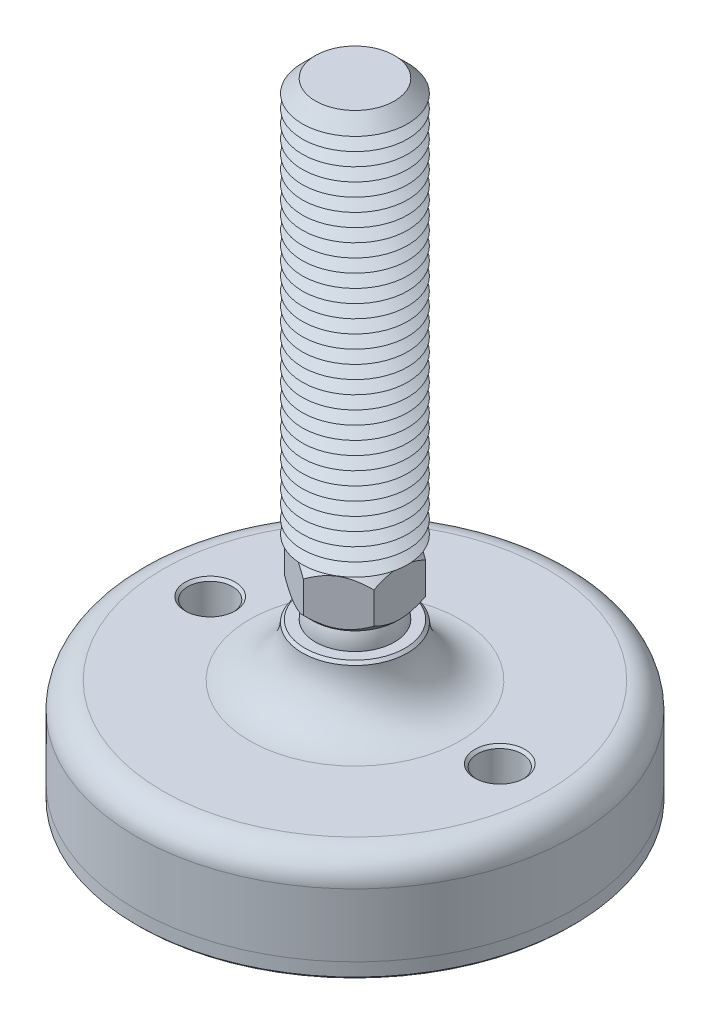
ISO-10303-21;
HEADER;
FILE_DESCRIPTION(('STEP AP214'),'2;1');
FILE_NAME('part.step','',(''),(''),'','','');
FILE_SCHEMA(('AUTOMOTIVE_DESIGN { 1 0 10303 214 1 1 1 1 }'));
ENDSEC;
DATA;
#1=APPLICATION_CONTEXT('core data for automotive mechanical design processes');
#2=APPLICATION_PROTOCOL_DEFINITION('international standard','automotive_design',2000,#1);
#3=PRODUCT_CONTEXT('',#1,'mechanical');
#4=PRODUCT('Part','Part','',(#3));
#5=PRODUCT_RELATED_PRODUCT_CATEGORY('part','',(#4));
#6=PRODUCT_DEFINITION_FORMATION('','',#4);
#7=PRODUCT_DEFINITION_CONTEXT('part definition',#1,'design');
#8=PRODUCT_DEFINITION('design','',#6,#7);
#9=PRODUCT_DEFINITION_SHAPE('','',#8);
#10=(LENGTH_UNIT() NAMED_UNIT(*) SI_UNIT(.MILLI.,.METRE.));
#11=(NAMED_UNIT(*) PLANE_ANGLE_UNIT() SI_UNIT($,.RADIAN.));
#12=(NAMED_UNIT(*) SI_UNIT($,.STERADIAN.) SOLID_ANGLE_UNIT());
#13=UNCERTAINTY_MEASURE_WITH_UNIT(LENGTH_MEASURE(1.E-05),#10,'distance_accuracy_value','');
#14=(GEOMETRIC_REPRESENTATION_CONTEXT(3) GLOBAL_UNCERTAINTY_ASSIGNED_CONTEXT((#13)) GLOBAL_UNIT_ASSIGNED_CONTEXT((#10,
#11,#12)) REPRESENTATION_CONTEXT('',''));
#15=CARTESIAN_POINT('',(0.,0.,0.));
#16=DIRECTION('',(0.,0.,1.));
#17=DIRECTION('',(1.,0.,0.));
#18=AXIS2_PLACEMENT_3D('',#15,#16,#17);
#19=CARTESIAN_POINT('',(0.,-27.,0.));
#20=DIRECTION('',(0.,1.,0.));
#21=DIRECTION('',(0.,0.,1.));
#22=AXIS2_PLACEMENT_3D('',#19,#20,#21);
#23=PLANE('',#22);
#24=CARTESIAN_POINT('',(-27.5,-27.,0.));
#25=DIRECTION('',(0.,1.,0.));
#26=DIRECTION('',(0.,0.,1.));
#27=AXIS2_PLACEMENT_3D('',#24,#25,#26);
#28=CIRCLE('',#27,4.25000000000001);
#29=CARTESIAN_POINT('',(-27.5,-27.,4.25000000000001));
#30=VERTEX_POINT('',#29);
#31=EDGE_CURVE('P0_E43',#30,#30,#28,.T.);
#32=ORIENTED_EDGE('',*,*,#31,.F.);
#33=EDGE_LOOP('',(#32));
#34=FACE_BOUND('',#33,.T.);
#35=CARTESIAN_POINT('',(27.5,-27.,0.));
#36=DIRECTION('',(0.,1.,0.));
#37=DIRECTION('',(0.,0.,1.));
#38=AXIS2_PLACEMENT_3D('',#35,#36,#37);
#39=CIRCLE('',#38,4.25000000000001);
#40=CARTESIAN_POINT('',(27.5,-27.,4.25000000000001));
#41=VERTEX_POINT('',#40);
#42=EDGE_CURVE('P0_E44',#41,#41,#39,.T.);
#43=ORIENTED_EDGE('',*,*,#42,.F.);
#44=EDGE_LOOP('',(#43));
#45=FACE_BOUND('',#44,.T.);
#46=CARTESIAN_POINT('',(0.,-27.,0.));
#47=DIRECTION('',(0.,1.,0.));
#48=DIRECTION('',(0.,0.,1.));
#49=AXIS2_PLACEMENT_3D('',#46,#47,#48);
#50=CIRCLE('',#49,41.5);
#51=CARTESIAN_POINT('',(0.,-27.,41.5));
#52=VERTEX_POINT('',#51);
#53=EDGE_CURVE('P0_E40',#52,#52,#50,.T.);
#54=ORIENTED_EDGE('',*,*,#53,.T.);
#55=EDGE_LOOP('',(#54));
#56=FACE_BOUND('',#55,.T.);
#57=ADVANCED_FACE('P0_F14',(#34,#45,#56),#23,.T.);
#58=CARTESIAN_POINT('',(0.,48.1654938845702,0.));
#59=DIRECTION('',(0.,1.,0.));
#60=DIRECTION('',(0.,0.,1.));
#61=AXIS2_PLACEMENT_3D('',#58,#59,#60);
#62=CYLINDRICAL_SURFACE('',#61,41.5);
#63=CARTESIAN_POINT('',(0.,-29.5,0.));
#64=DIRECTION('',(0.,-1.,0.));
#65=DIRECTION('',(0.,0.,-1.));
#66=AXIS2_PLACEMENT_3D('',#63,#64,#65);
#67=CIRCLE('',#66,41.5);
#68=CARTESIAN_POINT('',(0.,-29.5,-41.5));
#69=VERTEX_POINT('',#68);
#70=EDGE_CURVE('P0_E37',#69,#69,#67,.F.);
#71=ORIENTED_EDGE('',*,*,#70,.T.);
#72=EDGE_LOOP('',(#71));
#73=FACE_BOUND('',#72,.T.);
#74=ORIENTED_EDGE('',*,*,#53,.F.);
#75=EDGE_LOOP('',(#74));
#76=FACE_BOUND('',#75,.T.);
#77=ADVANCED_FACE('P0_F54',(#73,#76),#62,.T.);
#78=CARTESIAN_POINT('',(0.,-30.,41.5));
#79=DIRECTION('',(0.,-1.,0.));
#80=DIRECTION('',(0.,0.,-1.));
#81=AXIS2_PLACEMENT_3D('',#78,#79,#80);
#82=PLANE('',#81);
#83=CARTESIAN_POINT('',(27.5,-30.,0.));
#84=DIRECTION('',(0.,-1.,0.));
#85=DIRECTION('',(0.,0.,-1.));
#86=AXIS2_PLACEMENT_3D('',#83,#84,#85);
#87=CIRCLE('',#86,4.75);
#88=CARTESIAN_POINT('',(27.5,-30.,-4.75000000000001));
#89=VERTEX_POINT('',#88);
#90=EDGE_CURVE('P0_E25',#89,#89,#87,.F.);
#91=ORIENTED_EDGE('',*,*,#90,.T.);
#92=EDGE_LOOP('',(#91));
#93=FACE_BOUND('',#92,.T.);
#94=CARTESIAN_POINT('',(-27.5,-30.,0.));
#95=DIRECTION('',(0.,-1.,0.));
#96=DIRECTION('',(0.,0.,-1.));
#97=AXIS2_PLACEMENT_3D('',#94,#95,#96);
#98=CIRCLE('',#97,4.75);
#99=CARTESIAN_POINT('',(-27.5,-30.,-4.75));
#100=VERTEX_POINT('',#99);
#101=EDGE_CURVE('P0_E29',#100,#100,#98,.F.);
#102=ORIENTED_EDGE('',*,*,#101,.T.);
#103=EDGE_LOOP('',(#102));
#104=FACE_BOUND('',#103,.T.);
#105=CARTESIAN_POINT('',(0.,-30.,0.));
#106=DIRECTION('',(0.,-1.,0.));
#107=DIRECTION('',(0.,0.,-1.));
#108=AXIS2_PLACEMENT_3D('',#105,#106,#107);
#109=CIRCLE('',#108,41.);
#110=CARTESIAN_POINT('',(0.,-30.,-41.));
#111=VERTEX_POINT('',#110);
#112=EDGE_CURVE('P0_E34',#111,#111,#109,.T.);
#113=ORIENTED_EDGE('',*,*,#112,.T.);
#114=EDGE_LOOP('',(#113));
#115=FACE_BOUND('',#114,.T.);
#116=ADVANCED_FACE('P0_F61',(#93,#104,#115),#82,.T.);
#117=CARTESIAN_POINT('',(0.,-29.5,0.));
#118=DIRECTION('',(0.,1.,0.));
#119=DIRECTION('',(0.,0.,1.));
#120=AXIS2_PLACEMENT_3D('',#117,#118,#119);
#121=CONICAL_SURFACE('',#120,41.5,0.785398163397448);
#122=ORIENTED_EDGE('',*,*,#112,.F.);
#123=EDGE_LOOP('',(#122));
#124=FACE_BOUND('',#123,.T.);
#125=ORIENTED_EDGE('',*,*,#70,.F.);
#126=EDGE_LOOP('',(#125));
#127=FACE_BOUND('',#126,.T.);
#128=ADVANCED_FACE('P0_F68',(#124,#127),#121,.T.);
#129=CARTESIAN_POINT('',(27.5,-30.,0.));
#130=DIRECTION('',(0.,1.,0.));
#131=DIRECTION('',(0.,0.,1.));
#132=AXIS2_PLACEMENT_3D('',#129,#130,#131);
#133=CYLINDRICAL_SURFACE('',#132,4.25000000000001);
#134=CARTESIAN_POINT('',(27.5,-29.5,0.));
#135=DIRECTION('',(0.,-1.,0.));
#136=DIRECTION('',(0.,0.,-1.));
#137=AXIS2_PLACEMENT_3D('',#134,#135,#136);
#138=CIRCLE('',#137,4.25000000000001);
#139=CARTESIAN_POINT('',(27.5,-29.5,-4.25000000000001));
#140=VERTEX_POINT('',#139);
#141=EDGE_CURVE('P0_E21',#140,#140,#138,.T.);
#142=ORIENTED_EDGE('',*,*,#141,.T.);
#143=EDGE_LOOP('',(#142));
#144=FACE_BOUND('',#143,.T.);
#145=ORIENTED_EDGE('',*,*,#42,.T.);
#146=EDGE_LOOP('',(#145));
#147=FACE_BOUND('',#146,.T.);
#148=ADVANCED_FACE('P0_F74',(#144,#147),#133,.F.);
#149=CARTESIAN_POINT('',(-27.5,-30.,0.));
#150=DIRECTION('',(0.,1.,0.));
#151=DIRECTION('',(0.,0.,1.));
#152=AXIS2_PLACEMENT_3D('',#149,#150,#151);
#153=CYLINDRICAL_SURFACE('',#152,4.25000000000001);
#154=CARTESIAN_POINT('',(-27.5,-29.5,0.));
#155=DIRECTION('',(0.,-1.,0.));
#156=DIRECTION('',(0.,0.,-1.));
#157=AXIS2_PLACEMENT_3D('',#154,#155,#156);
#158=CIRCLE('',#157,4.25000000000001);
#159=CARTESIAN_POINT('',(-27.5,-29.5,-4.25000000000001));
#160=VERTEX_POINT('',#159);
#161=EDGE_CURVE('P0_E10',#160,#160,#158,.T.);
#162=ORIENTED_EDGE('',*,*,#161,.T.);
#163=EDGE_LOOP('',(#162));
#164=FACE_BOUND('',#163,.T.);
#165=ORIENTED_EDGE('',*,*,#31,.T.);
#166=EDGE_LOOP('',(#165));
#167=FACE_BOUND('',#166,.T.);
#168=ADVANCED_FACE('P0_F50',(#164,#167),#153,.F.);
#169=CARTESIAN_POINT('',(27.5,-30.,0.));
#170=DIRECTION('',(0.,-1.,0.));
#171=DIRECTION('',(0.,0.,-1.));
#172=AXIS2_PLACEMENT_3D('',#169,#170,#171);
#173=CONICAL_SURFACE('',#172,4.75,0.785398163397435);
#174=ORIENTED_EDGE('',*,*,#141,.F.);
#175=EDGE_LOOP('',(#174));
#176=FACE_BOUND('',#175,.T.);
#177=ORIENTED_EDGE('',*,*,#90,.F.);
#178=EDGE_LOOP('',(#177));
#179=FACE_BOUND('',#178,.T.);
#180=ADVANCED_FACE('P0_F76',(#176,#179),#173,.F.);
#181=CARTESIAN_POINT('',(-27.5,-30.,0.));
#182=DIRECTION('',(0.,-1.,0.));
#183=DIRECTION('',(0.,0.,-1.));
#184=AXIS2_PLACEMENT_3D('',#181,#182,#183);
#185=CONICAL_SURFACE('',#184,4.75,0.785398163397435);
#186=ORIENTED_EDGE('',*,*,#161,.F.);
#187=EDGE_LOOP('',(#186));
#188=FACE_BOUND('',#187,.T.);
#189=ORIENTED_EDGE('',*,*,#101,.F.);
#190=EDGE_LOOP('',(#189));
#191=FACE_BOUND('',#190,.T.);
#192=ADVANCED_FACE('P0_F16',(#188,#191),#185,.F.);
#193=CLOSED_SHELL('',(#57,#77,#116,#128,#148,#168,#180,#192));
#194=MANIFOLD_SOLID_BREP('P0_B1',#193);
#195=CARTESIAN_POINT('',(0.,3.75,0.));
#196=DIRECTION('',(0.,1.,0.));
#197=DIRECTION('',(0.,0.,1.));
#198=AXIS2_PLACEMENT_3D('',#195,#196,#197);
#199=PLANE('',#198);
#200=CARTESIAN_POINT('',(0.,3.75,0.));
#201=DIRECTION('',(0.,1.,0.));
#202=DIRECTION('',(0.,0.,1.));
#203=AXIS2_PLACEMENT_3D('',#200,#201,#202);
#204=CIRCLE('',#203,7.99624373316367);
#205=CARTESIAN_POINT('',(0.,3.75,7.99624373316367));
#206=VERTEX_POINT('',#205);
#207=EDGE_CURVE('P1_E211',#206,#206,#204,.T.);
#208=ORIENTED_EDGE('',*,*,#207,.F.);
#209=EDGE_LOOP('',(#208));
#210=FACE_BOUND('',#209,.T.);
#211=CARTESIAN_POINT('',(0.,3.75,0.));
#212=DIRECTION('',(0.,1.,0.));
#213=DIRECTION('',(0.,0.,1.));
#214=AXIS2_PLACEMENT_3D('',#211,#212,#213);
#215=CIRCLE('',#214,6.49519052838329);
#216=CARTESIAN_POINT('',(0.,3.75,6.49519052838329));
#217=VERTEX_POINT('',#216);
#218=EDGE_CURVE('P1_E24',#217,#217,#215,.F.);
#219=ORIENTED_EDGE('',*,*,#218,.F.);
#220=EDGE_LOOP('',(#219));
#221=FACE_BOUND('',#220,.T.);
#222=ADVANCED_FACE('P1_F16',(#210,#221),#199,.F.);
#223=CARTESIAN_POINT('',(0.,0.,0.));
#224=DIRECTION('',(0.,1.,0.));
#225=DIRECTION('',(0.,0.,-1.));
#226=AXIS2_PLACEMENT_3D('',#223,#224,#225);
#227=SPHERICAL_SURFACE('',#226,7.5);
#228=ORIENTED_EDGE('',*,*,#218,.T.);
#229=EDGE_LOOP('',(#228));
#230=FACE_BOUND('',#229,.T.);
#231=ADVANCED_FACE('P1_F201',(#230),#227,.T.);
#232=CARTESIAN_POINT('',(0.,3.75,0.));
#233=DIRECTION('',(0.,1.,0.));
#234=DIRECTION('',(0.,0.,1.));
#235=AXIS2_PLACEMENT_3D('',#232,#233,#234);
#236=CONICAL_SURFACE('',#235,7.99624373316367,0.785398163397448);
#237=ORIENTED_EDGE('',*,*,#207,.T.);
#238=EDGE_LOOP('',(#237));
#239=FACE_BOUND('',#238,.T.);
#240=CARTESIAN_POINT('',(-8.5,8.90811002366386,-10.0392740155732));
#241=CARTESIAN_POINT('',(-8.5,8.72243436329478,-9.79593020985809));
#242=CARTESIAN_POINT('',(-8.5,8.53847898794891,-9.55125250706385));
#243=CARTESIAN_POINT('',(-8.5,8.17478786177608,-9.05869243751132));
#244=CARTESIAN_POINT('',(-8.5,7.99505314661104,-8.81080930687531));
#245=CARTESIAN_POINT('',(-8.5,7.63930320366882,-8.30948839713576));
#246=CARTESIAN_POINT('',(-8.5,7.46332748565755,-8.05602248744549));
#247=CARTESIAN_POINT('',(-8.5,7.11769199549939,-7.54483399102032));
#248=CARTESIAN_POINT('',(-8.5,6.94803178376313,-7.28711170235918));
#249=CARTESIAN_POINT('',(-8.5,6.60640236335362,-6.75094027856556));
#250=CARTESIAN_POINT('',(-8.5,6.43491645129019,-6.47218164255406));
#251=CARTESIAN_POINT('',(-8.5,6.10286460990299,-5.90813314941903));
#252=CARTESIAN_POINT('',(-8.5,5.94230047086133,-5.62284223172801));
#253=CARTESIAN_POINT('',(-8.5,5.63553180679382,-5.04569727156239));
#254=CARTESIAN_POINT('',(-8.5,5.48928508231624,-4.75386583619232));
#255=CARTESIAN_POINT('',(-8.5,5.21442695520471,-4.16207917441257));
#256=CARTESIAN_POINT('',(-8.5,5.08580737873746,-3.86212779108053));
#257=CARTESIAN_POINT('',(-8.5,4.86150447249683,-3.28118098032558));
#258=CARTESIAN_POINT('',(-8.5,4.7638906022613,-3.00093864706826));
#259=CARTESIAN_POINT('',(-8.5,4.59111419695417,-2.43348682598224));
#260=CARTESIAN_POINT('',(-8.5,4.51595314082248,-2.14627688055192));
#261=CARTESIAN_POINT('',(-8.5,4.39333737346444,-1.57150580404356));
#262=CARTESIAN_POINT('',(-8.5,4.34539220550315,-1.28405106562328));
#263=CARTESIAN_POINT('',(-8.5,4.27817908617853,-0.705789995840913));
#264=CARTESIAN_POINT('',(-8.5,4.25890565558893,-0.41498431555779));
#265=CARTESIAN_POINT('',(-8.5,4.25058550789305,0.155345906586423));
#266=CARTESIAN_POINT('',(-8.5,4.2603535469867,0.434853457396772));
#267=CARTESIAN_POINT('',(-8.5,4.30689978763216,0.991595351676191));
#268=CARTESIAN_POINT('',(-8.5,4.34368052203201,1.26882947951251));
#269=CARTESIAN_POINT('',(-8.5,4.44283018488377,1.82371054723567));
#270=CARTESIAN_POINT('',(-8.5,4.50564357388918,2.10127674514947));
#271=CARTESIAN_POINT('',(-8.5,4.65343378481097,2.6503272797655));
#272=CARTESIAN_POINT('',(-8.5,4.73840907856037,2.9218120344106));
#273=CARTESIAN_POINT('',(-8.5,4.93373614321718,3.47773657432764));
#274=CARTESIAN_POINT('',(-8.5,5.04548526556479,3.7616800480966));
#275=CARTESIAN_POINT('',(-8.5,5.28620549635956,4.3222352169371));
#276=CARTESIAN_POINT('',(-8.5,5.41518447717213,4.59884349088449));
#277=CARTESIAN_POINT('',(-8.5,5.68730204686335,5.14605293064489));
#278=CARTESIAN_POINT('',(-8.5,5.8304846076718,5.41663205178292));
#279=CARTESIAN_POINT('',(-8.5,6.1278527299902,5.95157955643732));
#280=CARTESIAN_POINT('',(-8.5,6.28203657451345,6.21594890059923));
#281=CARTESIAN_POINT('',(-8.5,6.59139861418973,6.7263367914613));
#282=CARTESIAN_POINT('',(-8.5,6.74614943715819,6.97261575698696));
#283=CARTESIAN_POINT('',(-8.5,7.06220691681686,7.46094357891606));
#284=CARTESIAN_POINT('',(-8.5,7.22351406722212,7.70299211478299));
#285=CARTESIAN_POINT('',(-8.5,7.55019288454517,8.18145952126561));
#286=CARTESIAN_POINT('',(-8.5,7.71552125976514,8.4179080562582));
#287=CARTESIAN_POINT('',(-8.5,8.05058640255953,8.88756615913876));
#288=CARTESIAN_POINT('',(-8.5,8.22032194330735,9.12077660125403));
#289=CARTESIAN_POINT('',(-8.5,8.39186061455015,9.35262965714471));
#290=B_SPLINE_CURVE_WITH_KNOTS('',3,(#240,#241,#242,#243,#244,#245,#246,#247,#248,#249,#250,
#251,#252,#253,#254,#255,#256,#257,#258,#259,#260,#261,#262,#263,#264,#265,#266,#267,#268,#269,
#270,#271,#272,#273,#274,#275,#276,#277,#278,#279,#280,#281,#282,#283,#284,#285,#286,#287,#288,
#289),.UNSPECIFIED.,.F.,.F.,(4,2,2,2,2,2,2,2,2,2,2,2,2,2,2,2,2,2,2,2,2,2,2,2,4),(0.,
0.918290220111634,1.8368034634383,2.76241942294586,3.68797083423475,4.66961920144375,
5.65142809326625,6.63025007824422,7.60861662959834,8.49811159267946,9.38766513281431,
10.2606329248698,11.1334338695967,11.9711093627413,12.8088634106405,13.6615517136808,
14.5141812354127,15.4289018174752,16.3440417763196,17.2621089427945,18.1800331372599,
19.0524996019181,19.9250318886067,20.7905246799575,21.6557790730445),.UNSPECIFIED.);
#291=CARTESIAN_POINT('',(-8.5,5.56871084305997,-4.90747728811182));
#292=VERTEX_POINT('',#291);
#293=CARTESIAN_POINT('',(-8.5,5.56871084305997,4.90747728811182));
#294=VERTEX_POINT('',#293);
#295=EDGE_CURVE('P1_E185',#292,#294,#290,.T.);
#296=ORIENTED_EDGE('',*,*,#295,.F.);
#297=CARTESIAN_POINT('',(0.000199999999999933,5.5688263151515,-9.81507004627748));
#298=CARTESIAN_POINT('',(-0.145938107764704,5.48446627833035,-9.73069717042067));
#299=CARTESIAN_POINT('',(-0.293216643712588,5.40268088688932,-9.6456658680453));
#300=CARTESIAN_POINT('',(-0.590240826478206,5.24507616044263,-9.47417887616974));
#301=CARTESIAN_POINT('',(-0.739987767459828,5.16926008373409,-9.38772243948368));
#302=CARTESIAN_POINT('',(-1.0428413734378,5.02408965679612,-9.21286982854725));
#303=CARTESIAN_POINT('',(-1.19596236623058,4.95477479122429,-9.12446538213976));
#304=CARTESIAN_POINT('',(-1.50468648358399,4.82411695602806,-8.94622342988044));
#305=CARTESIAN_POINT('',(-1.66028922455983,4.76277276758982,-8.85638614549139));
#306=CARTESIAN_POINT('',(-2.12594374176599,4.59407400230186,-8.58754038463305));
#307=CARTESIAN_POINT('',(-2.4397129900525,4.49965525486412,-8.4063856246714));
#308=CARTESIAN_POINT('',(-2.91546156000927,4.39044680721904,-8.13171205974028));
#309=CARTESIAN_POINT('',(-3.07473438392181,4.35946186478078,-8.03975585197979));
#310=CARTESIAN_POINT('',(-3.39463410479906,4.3089933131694,-7.85506166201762));
#311=CARTESIAN_POINT('',(-3.5552607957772,4.28950798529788,-7.76232379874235));
#312=CARTESIAN_POINT('',(-3.9466882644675,4.25683795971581,-7.5363330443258));
#313=CARTESIAN_POINT('',(-4.17791015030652,4.24998362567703,-7.4028370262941));
#314=CARTESIAN_POINT('',(-4.63993781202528,4.26149030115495,-7.13608523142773));
#315=CARTESIAN_POINT('',(-4.87074341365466,4.27986014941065,-7.00282955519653));
#316=CARTESIAN_POINT('',(-5.33017839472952,4.34073256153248,-6.73757464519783));
#317=CARTESIAN_POINT('',(-5.55880504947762,4.38326211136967,-6.60557698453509));
#318=CARTESIAN_POINT('',(-6.01212885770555,4.49014170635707,-6.34385036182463));
#319=CARTESIAN_POINT('',(-6.23682631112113,4.55449007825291,-6.21412122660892));
#320=CARTESIAN_POINT('',(-6.63569693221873,4.686871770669,-5.98383316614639));
#321=CARTESIAN_POINT('',(-6.81075347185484,4.75142294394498,-5.88276422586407));
#322=CARTESIAN_POINT('',(-7.15772421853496,4.89092708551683,-5.68244057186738));
#323=CARTESIAN_POINT('',(-7.3296383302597,4.96588036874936,-5.58318591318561));
#324=CARTESIAN_POINT('',(-7.6697827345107,5.12450866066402,-5.38680344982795));
#325=CARTESIAN_POINT('',(-7.8380227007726,5.20815624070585,-5.28967006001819));
#326=CARTESIAN_POINT('',(-8.17138743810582,5.38307502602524,-5.09720183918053));
#327=CARTESIAN_POINT('',(-8.33651404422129,5.47434155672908,-5.00186594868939));
#328=CARTESIAN_POINT('',(-8.5002,5.5688263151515,-4.90736181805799));
#329=B_SPLINE_CURVE_WITH_KNOTS('',3,(#297,#298,#299,#300,#301,#302,#303,#304,#305,#306,#307,
#308,#309,#310,#311,#312,#313,#314,#315,#316,#317,#318,#319,#320,#321,#322,#323,#324,#325,#326,
#327,#328),.UNSPECIFIED.,.F.,.F.,(4,2,2,2,2,2,2,2,2,2,2,2,2,2,2,4),(0.,0.565988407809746,
1.13228364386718,1.70182141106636,2.27127198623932,3.39189520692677,3.95110786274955,
4.510236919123,5.31023384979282,6.11051117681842,6.91168416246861,7.71279572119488,
8.34908108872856,8.98538572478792,9.61974061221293,10.2537091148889),.UNSPECIFIED.);
#330=CARTESIAN_POINT('',(0.,5.56871084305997,-9.81495457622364));
#331=VERTEX_POINT('',#330);
#332=EDGE_CURVE('P1_E179',#331,#292,#329,.T.);
#333=ORIENTED_EDGE('',*,*,#332,.F.);
#334=CARTESIAN_POINT('',(8.5002,5.56882631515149,-4.90736181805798));
#335=CARTESIAN_POINT('',(8.3540618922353,5.48446627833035,-4.9917346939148));
#336=CARTESIAN_POINT('',(8.20678335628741,5.40268088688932,-5.07676599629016));
#337=CARTESIAN_POINT('',(7.90975917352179,5.24507616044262,-5.24825298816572));
#338=CARTESIAN_POINT('',(7.76001223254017,5.16926008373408,-5.33470942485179));
#339=CARTESIAN_POINT('',(7.4571586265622,5.02408965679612,-5.50956203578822));
#340=CARTESIAN_POINT('',(7.30403763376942,4.95477479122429,-5.59796648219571));
#341=CARTESIAN_POINT('',(6.99531351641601,4.82411695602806,-5.77620843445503));
#342=CARTESIAN_POINT('',(6.83971077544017,4.76277276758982,-5.86604571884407));
#343=CARTESIAN_POINT('',(6.37405625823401,4.59407400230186,-6.13489147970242));
#344=CARTESIAN_POINT('',(6.0602870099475,4.49965525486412,-6.31604623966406));
#345=CARTESIAN_POINT('',(5.58453843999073,4.39044680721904,-6.59071980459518));
#346=CARTESIAN_POINT('',(5.42526561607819,4.35946186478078,-6.68267601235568));
#347=CARTESIAN_POINT('',(5.10536589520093,4.3089933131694,-6.86737020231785));
#348=CARTESIAN_POINT('',(4.9447392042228,4.28950798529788,-6.96010806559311));
#349=CARTESIAN_POINT('',(4.5533117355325,4.25683795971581,-7.18609882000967));
#350=CARTESIAN_POINT('',(4.32208984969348,4.24998362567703,-7.31959483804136));
#351=CARTESIAN_POINT('',(3.86006218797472,4.26149030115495,-7.58634663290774));
#352=CARTESIAN_POINT('',(3.62925658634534,4.27986014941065,-7.71960230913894));
#353=CARTESIAN_POINT('',(3.16982160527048,4.34073256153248,-7.98485721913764));
#354=CARTESIAN_POINT('',(2.94119495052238,4.38326211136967,-8.11685487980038));
#355=CARTESIAN_POINT('',(2.48787114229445,4.49014170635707,-8.37858150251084));
#356=CARTESIAN_POINT('',(2.26317368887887,4.55449007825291,-8.50831063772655));
#357=CARTESIAN_POINT('',(1.86430306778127,4.686871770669,-8.73859869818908));
#358=CARTESIAN_POINT('',(1.68924652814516,4.75142294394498,-8.83966763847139));
#359=CARTESIAN_POINT('',(1.34227578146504,4.89092708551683,-9.03999129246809));
#360=CARTESIAN_POINT('',(1.1703616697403,4.96588036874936,-9.13924595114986));
#361=CARTESIAN_POINT('',(0.8302172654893,5.12450866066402,-9.33562841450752));
#362=CARTESIAN_POINT('',(0.661977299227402,5.20815624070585,-9.43276180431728));
#363=CARTESIAN_POINT('',(0.328612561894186,5.38307502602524,-9.62523002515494));
#364=CARTESIAN_POINT('',(0.163485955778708,5.47434155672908,-9.72056591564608));
#365=CARTESIAN_POINT('',(-0.000200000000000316,5.5688263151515,-9.81507004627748));
#366=B_SPLINE_CURVE_WITH_KNOTS('',3,(#334,#335,#336,#337,#338,#339,#340,#341,#342,#343,#344,
#345,#346,#347,#348,#349,#350,#351,#352,#353,#354,#355,#356,#357,#358,#359,#360,#361,#362,#363,
#364,#365),.UNSPECIFIED.,.F.,.F.,(4,2,2,2,2,2,2,2,2,2,2,2,2,2,2,4),(0.,0.565988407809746,
1.13228364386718,1.70182141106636,2.27127198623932,3.39189520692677,3.95110786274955,
4.510236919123,5.31023384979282,6.11051117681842,6.91168416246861,7.71279572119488,
8.34908108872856,8.98538572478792,9.61974061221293,10.2537091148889),.UNSPECIFIED.);
#367=CARTESIAN_POINT('',(8.5,5.56871084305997,-4.90747728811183));
#368=VERTEX_POINT('',#367);
#369=EDGE_CURVE('P1_E167',#368,#331,#366,.T.);
#370=ORIENTED_EDGE('',*,*,#369,.F.);
#371=CARTESIAN_POINT('',(8.5,8.90811002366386,-10.0392740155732));
#372=CARTESIAN_POINT('',(8.5,8.72243436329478,-9.79593020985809));
#373=CARTESIAN_POINT('',(8.5,8.5384789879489,-9.55125250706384));
#374=CARTESIAN_POINT('',(8.5,8.17478786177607,-9.05869243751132));
#375=CARTESIAN_POINT('',(8.5,7.99505314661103,-8.81080930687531));
#376=CARTESIAN_POINT('',(8.5,7.63930320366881,-8.30948839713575));
#377=CARTESIAN_POINT('',(8.5,7.46332748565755,-8.05602248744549));
#378=CARTESIAN_POINT('',(8.5,7.11769199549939,-7.54483399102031));
#379=CARTESIAN_POINT('',(8.5,6.94803178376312,-7.28711170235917));
#380=CARTESIAN_POINT('',(8.5,6.60640236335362,-6.75094027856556));
#381=CARTESIAN_POINT('',(8.5,6.43491645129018,-6.47218164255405));
#382=CARTESIAN_POINT('',(8.5,6.10286460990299,-5.90813314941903));
#383=CARTESIAN_POINT('',(8.5,5.94230047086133,-5.62284223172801));
#384=CARTESIAN_POINT('',(8.5,5.63553180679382,-5.04569727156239));
#385=CARTESIAN_POINT('',(8.5,5.48928508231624,-4.75386583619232));
#386=CARTESIAN_POINT('',(8.5,5.21442695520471,-4.16207917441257));
#387=CARTESIAN_POINT('',(8.5,5.08580737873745,-3.86212779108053));
#388=CARTESIAN_POINT('',(8.5,4.86150447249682,-3.28118098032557));
#389=CARTESIAN_POINT('',(8.5,4.7638906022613,-3.00093864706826));
#390=CARTESIAN_POINT('',(8.5,4.59111419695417,-2.43348682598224));
#391=CARTESIAN_POINT('',(8.5,4.51595314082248,-2.14627688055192));
#392=CARTESIAN_POINT('',(8.5,4.39333737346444,-1.57150580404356));
#393=CARTESIAN_POINT('',(8.5,4.34539220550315,-1.28405106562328));
#394=CARTESIAN_POINT('',(8.5,4.27817908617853,-0.705789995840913));
#395=CARTESIAN_POINT('',(8.5,4.25890565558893,-0.41498431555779));
#396=CARTESIAN_POINT('',(8.5,4.25058550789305,0.155345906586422));
#397=CARTESIAN_POINT('',(8.5,4.2603535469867,0.434853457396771));
#398=CARTESIAN_POINT('',(8.5,4.30689978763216,0.99159535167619));
#399=CARTESIAN_POINT('',(8.5,4.34368052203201,1.2688294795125));
#400=CARTESIAN_POINT('',(8.5,4.44283018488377,1.82371054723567));
#401=CARTESIAN_POINT('',(8.5,4.50564357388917,2.10127674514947));
#402=CARTESIAN_POINT('',(8.5,4.65343378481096,2.65032727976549));
#403=CARTESIAN_POINT('',(8.5,4.73840907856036,2.9218120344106));
#404=CARTESIAN_POINT('',(8.5,4.93373614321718,3.47773657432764));
#405=CARTESIAN_POINT('',(8.5,5.04548526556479,3.7616800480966));
#406=CARTESIAN_POINT('',(8.5,5.28620549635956,4.3222352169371));
#407=CARTESIAN_POINT('',(8.5,5.41518447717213,4.59884349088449));
#408=CARTESIAN_POINT('',(8.5,5.68730204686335,5.14605293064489));
#409=CARTESIAN_POINT('',(8.5,5.8304846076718,5.41663205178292));
#410=CARTESIAN_POINT('',(8.5,6.1278527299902,5.95157955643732));
#411=CARTESIAN_POINT('',(8.5,6.28203657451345,6.21594890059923));
#412=CARTESIAN_POINT('',(8.5,6.59139861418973,6.7263367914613));
#413=CARTESIAN_POINT('',(8.5,6.74614943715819,6.97261575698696));
#414=CARTESIAN_POINT('',(8.5,7.06220691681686,7.46094357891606));
#415=CARTESIAN_POINT('',(8.5,7.22351406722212,7.70299211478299));
#416=CARTESIAN_POINT('',(8.5,7.55019288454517,8.18145952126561));
#417=CARTESIAN_POINT('',(8.5,7.71552125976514,8.4179080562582));
#418=CARTESIAN_POINT('',(8.5,8.05058640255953,8.88756615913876));
#419=CARTESIAN_POINT('',(8.5,8.22032194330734,9.12077660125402));
#420=CARTESIAN_POINT('',(8.5,8.39186061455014,9.35262965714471));
#421=B_SPLINE_CURVE_WITH_KNOTS('',3,(#371,#372,#373,#374,#375,#376,#377,#378,#379,#380,#381,
#382,#383,#384,#385,#386,#387,#388,#389,#390,#391,#392,#393,#394,#395,#396,#397,#398,#399,#400,
#401,#402,#403,#404,#405,#406,#407,#408,#409,#410,#411,#412,#413,#414,#415,#416,#417,#418,#419,
#420),.UNSPECIFIED.,.F.,.F.,(4,2,2,2,2,2,2,2,2,2,2,2,2,2,2,2,2,2,2,2,2,2,2,2,4),(0.,
0.918290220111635,1.8368034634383,2.76241942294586,3.68797083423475,4.66961920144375,
5.65142809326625,6.63025007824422,7.60861662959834,8.49811159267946,9.38766513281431,
10.2606329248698,11.1334338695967,11.9711093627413,12.8088634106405,13.6615517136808,
14.5141812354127,15.4289018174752,16.3440417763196,17.2621089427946,18.1800331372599,
19.0524996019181,19.9250318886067,20.7905246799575,21.6557790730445),.UNSPECIFIED.);
#422=CARTESIAN_POINT('',(8.5,5.56871084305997,4.90747728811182));
#423=VERTEX_POINT('',#422);
#424=EDGE_CURVE('P1_E70',#423,#368,#421,.F.);
#425=ORIENTED_EDGE('',*,*,#424,.F.);
#426=CARTESIAN_POINT('',(-0.000200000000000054,5.56882631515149,9.81507004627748));
#427=CARTESIAN_POINT('',(0.145938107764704,5.48446627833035,9.73069717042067));
#428=CARTESIAN_POINT('',(0.293216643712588,5.40268088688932,9.6456658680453));
#429=CARTESIAN_POINT('',(0.590240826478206,5.24507616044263,9.47417887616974));
#430=CARTESIAN_POINT('',(0.739987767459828,5.16926008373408,9.38772243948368));
#431=CARTESIAN_POINT('',(1.0428413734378,5.02408965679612,9.21286982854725));
#432=CARTESIAN_POINT('',(1.19596236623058,4.95477479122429,9.12446538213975));
#433=CARTESIAN_POINT('',(1.50468648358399,4.82411695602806,8.94622342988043));
#434=CARTESIAN_POINT('',(1.66028922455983,4.76277276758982,8.85638614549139));
#435=CARTESIAN_POINT('',(2.12594374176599,4.59407400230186,8.58754038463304));
#436=CARTESIAN_POINT('',(2.4397129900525,4.49965525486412,8.4063856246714));
#437=CARTESIAN_POINT('',(2.91546156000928,4.39044680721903,8.13171205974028));
#438=CARTESIAN_POINT('',(3.07473438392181,4.35946186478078,8.03975585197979));
#439=CARTESIAN_POINT('',(3.39463410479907,4.3089933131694,7.85506166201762));
#440=CARTESIAN_POINT('',(3.55526079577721,4.28950798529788,7.76232379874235));
#441=CARTESIAN_POINT('',(3.9466882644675,4.25683795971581,7.53633304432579));
#442=CARTESIAN_POINT('',(4.17791015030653,4.24998362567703,7.4028370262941));
#443=CARTESIAN_POINT('',(4.63993781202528,4.26149030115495,7.13608523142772));
#444=CARTESIAN_POINT('',(4.87074341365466,4.27986014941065,7.00282955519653));
#445=CARTESIAN_POINT('',(5.33017839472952,4.34073256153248,6.73757464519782));
#446=CARTESIAN_POINT('',(5.55880504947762,4.38326211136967,6.60557698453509));
#447=CARTESIAN_POINT('',(6.01212885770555,4.49014170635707,6.34385036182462));
#448=CARTESIAN_POINT('',(6.23682631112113,4.55449007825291,6.21412122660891));
#449=CARTESIAN_POINT('',(6.63569693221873,4.686871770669,5.98383316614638));
#450=CARTESIAN_POINT('',(6.81075347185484,4.75142294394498,5.88276422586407));
#451=CARTESIAN_POINT('',(7.15772421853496,4.89092708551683,5.68244057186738));
#452=CARTESIAN_POINT('',(7.3296383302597,4.96588036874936,5.58318591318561));
#453=CARTESIAN_POINT('',(7.6697827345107,5.12450866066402,5.38680344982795));
#454=CARTESIAN_POINT('',(7.8380227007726,5.20815624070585,5.28967006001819));
#455=CARTESIAN_POINT('',(8.17138743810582,5.38307502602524,5.09720183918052));
#456=CARTESIAN_POINT('',(8.33651404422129,5.47434155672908,5.00186594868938));
#457=CARTESIAN_POINT('',(8.5002,5.56882631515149,4.90736181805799));
#458=B_SPLINE_CURVE_WITH_KNOTS('',3,(#426,#427,#428,#429,#430,#431,#432,#433,#434,#435,#436,
#437,#438,#439,#440,#441,#442,#443,#444,#445,#446,#447,#448,#449,#450,#451,#452,#453,#454,#455,
#456,#457),.UNSPECIFIED.,.F.,.F.,(4,2,2,2,2,2,2,2,2,2,2,2,2,2,2,4),(0.,0.565988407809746,
1.13228364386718,1.70182141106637,2.27127198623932,3.39189520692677,3.95110786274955,
4.51023691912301,5.31023384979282,6.11051117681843,6.91168416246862,7.71279572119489,
8.34908108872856,8.98538572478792,9.61974061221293,10.2537091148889),.UNSPECIFIED.);
#459=CARTESIAN_POINT('',(0.,5.56871084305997,9.81495457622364));
#460=VERTEX_POINT('',#459);
#461=EDGE_CURVE('P1_E67',#460,#423,#458,.T.);
#462=ORIENTED_EDGE('',*,*,#461,.F.);
#463=CARTESIAN_POINT('',(-8.5002,5.56882631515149,4.90736181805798));
#464=CARTESIAN_POINT('',(-8.3540618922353,5.48446627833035,4.9917346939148));
#465=CARTESIAN_POINT('',(-8.20678335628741,5.40268088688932,5.07676599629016));
#466=CARTESIAN_POINT('',(-7.90975917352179,5.24507616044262,5.24825298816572));
#467=CARTESIAN_POINT('',(-7.76001223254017,5.16926008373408,5.33470942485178));
#468=CARTESIAN_POINT('',(-7.4571586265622,5.02408965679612,5.50956203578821));
#469=CARTESIAN_POINT('',(-7.30403763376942,4.95477479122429,5.59796648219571));
#470=CARTESIAN_POINT('',(-6.99531351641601,4.82411695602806,5.77620843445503));
#471=CARTESIAN_POINT('',(-6.83971077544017,4.76277276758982,5.86604571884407));
#472=CARTESIAN_POINT('',(-6.37405625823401,4.59407400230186,6.13489147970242));
#473=CARTESIAN_POINT('',(-6.0602870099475,4.49965525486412,6.31604623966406));
#474=CARTESIAN_POINT('',(-5.58453843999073,4.39044680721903,6.59071980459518));
#475=CARTESIAN_POINT('',(-5.42526561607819,4.35946186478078,6.68267601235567));
#476=CARTESIAN_POINT('',(-5.10536589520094,4.30899331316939,6.86737020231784));
#477=CARTESIAN_POINT('',(-4.9447392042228,4.28950798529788,6.96010806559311));
#478=CARTESIAN_POINT('',(-4.5533117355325,4.25683795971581,7.18609882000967));
#479=CARTESIAN_POINT('',(-4.32208984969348,4.24998362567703,7.31959483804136));
#480=CARTESIAN_POINT('',(-3.86006218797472,4.26149030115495,7.58634663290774));
#481=CARTESIAN_POINT('',(-3.62925658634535,4.27986014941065,7.71960230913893));
#482=CARTESIAN_POINT('',(-3.16982160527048,4.34073256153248,7.98485721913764));
#483=CARTESIAN_POINT('',(-2.94119495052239,4.38326211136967,8.11685487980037));
#484=CARTESIAN_POINT('',(-2.48787114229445,4.49014170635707,8.37858150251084));
#485=CARTESIAN_POINT('',(-2.26317368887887,4.55449007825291,8.50831063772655));
#486=CARTESIAN_POINT('',(-1.86430306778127,4.686871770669,8.73859869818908));
#487=CARTESIAN_POINT('',(-1.68924652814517,4.75142294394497,8.83966763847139));
#488=CARTESIAN_POINT('',(-1.34227578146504,4.89092708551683,9.03999129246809));
#489=CARTESIAN_POINT('',(-1.1703616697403,4.96588036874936,9.13924595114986));
#490=CARTESIAN_POINT('',(-0.830217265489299,5.12450866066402,9.33562841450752));
#491=CARTESIAN_POINT('',(-0.6619772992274,5.20815624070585,9.43276180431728));
#492=CARTESIAN_POINT('',(-0.328612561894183,5.38307502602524,9.62523002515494));
#493=CARTESIAN_POINT('',(-0.163485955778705,5.47434155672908,9.72056591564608));
#494=CARTESIAN_POINT('',(0.000200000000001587,5.5688263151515,9.81507004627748));
#495=B_SPLINE_CURVE_WITH_KNOTS('',3,(#463,#464,#465,#466,#467,#468,#469,#470,#471,#472,#473,
#474,#475,#476,#477,#478,#479,#480,#481,#482,#483,#484,#485,#486,#487,#488,#489,#490,#491,#492,
#493,#494),.UNSPECIFIED.,.F.,.F.,(4,2,2,2,2,2,2,2,2,2,2,2,2,2,2,4),(0.,0.565988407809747,
1.13228364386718,1.70182141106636,2.27127198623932,3.39189520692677,3.95110786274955,
4.510236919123,5.31023384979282,6.11051117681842,6.91168416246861,7.71279572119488,
8.34908108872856,8.98538572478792,9.61974061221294,10.2537091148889),.UNSPECIFIED.);
#496=EDGE_CURVE('P1_E39',#294,#460,#495,.T.);
#497=ORIENTED_EDGE('',*,*,#496,.F.);
#498=EDGE_LOOP('',(#296,#333,#370,#425,#462,#497));
#499=FACE_BOUND('',#498,.T.);
#500=ADVANCED_FACE('P1_F68',(#239,#499),#236,.T.);
#501=CARTESIAN_POINT('',(-8.5,14.,-4.90747728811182));
#502=DIRECTION('',(1.,0.,0.));
#503=DIRECTION('',(0.,0.,-1.));
#504=AXIS2_PLACEMENT_3D('',#501,#502,#503);
#505=PLANE('',#504);
#506=DIRECTION('',(0.,-1.,0.));
#507=VECTOR('',#506,1.);
#508=CARTESIAN_POINT('',(-8.5,14.,4.90747728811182));
#509=LINE('',#508,#507);
#510=CARTESIAN_POINT('',(-8.5,11.5462613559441,4.90747728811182));
#511=VERTEX_POINT('',#510);
#512=EDGE_CURVE('P1_E83',#511,#294,#509,.T.);
#513=ORIENTED_EDGE('',*,*,#512,.F.);
#514=CARTESIAN_POINT('',(-8.5,8.39798309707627,-9.78751273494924));
#515=CARTESIAN_POINT('',(-8.5,8.57787513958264,-9.54919755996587));
#516=CARTESIAN_POINT('',(-8.5,8.75602828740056,-9.30954807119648));
#517=CARTESIAN_POINT('',(-8.5,9.10807823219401,-8.827054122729));
#518=CARTESIAN_POINT('',(-8.5,9.2819739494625,-8.58420887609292));
#519=CARTESIAN_POINT('',(-8.5,9.62596686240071,-8.09302066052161));
#520=CARTESIAN_POINT('',(-8.5,9.79602418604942,-7.84464967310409));
#521=CARTESIAN_POINT('',(-8.5,10.1297912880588,-7.34369187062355));
#522=CARTESIAN_POINT('',(-8.5,10.2935015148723,-7.09110535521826));
#523=CARTESIAN_POINT('',(-8.5,10.6222985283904,-6.566468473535));
#524=CARTESIAN_POINT('',(-8.5,10.7869291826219,-6.29413078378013));
#525=CARTESIAN_POINT('',(-8.5,11.1053589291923,-5.74309849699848));
#526=CARTESIAN_POINT('',(-8.5,11.259156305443,-5.464402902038));
#527=CARTESIAN_POINT('',(-8.5,11.5526010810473,-4.90068072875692));
#528=CARTESIAN_POINT('',(-8.5,11.6922900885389,-4.61567598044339));
#529=CARTESIAN_POINT('',(-8.5,11.9543910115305,-4.0378936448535));
#530=CARTESIAN_POINT('',(-8.5,12.0768107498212,-3.74511964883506));
#531=CARTESIAN_POINT('',(-8.5,12.2910322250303,-3.17524396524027));
#532=CARTESIAN_POINT('',(-8.5,12.38450510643,-2.89877705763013));
#533=CARTESIAN_POINT('',(-8.5,12.5492711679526,-2.33918702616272));
#534=CARTESIAN_POINT('',(-8.5,12.6205628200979,-2.05606344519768));
#535=CARTESIAN_POINT('',(-8.5,12.7360573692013,-1.48955968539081));
#536=CARTESIAN_POINT('',(-8.5,12.7807243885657,-1.2062756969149));
#537=CARTESIAN_POINT('',(-8.5,12.8421027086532,-0.636679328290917));
#538=CARTESIAN_POINT('',(-8.5,12.8588188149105,-0.35036747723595));
#539=CARTESIAN_POINT('',(-8.5,12.8630538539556,0.212098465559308));
#540=CARTESIAN_POINT('',(-8.5,12.8516076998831,0.488245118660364));
#541=CARTESIAN_POINT('',(-8.5,12.8024337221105,1.03817300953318));
#542=CARTESIAN_POINT('',(-8.5,12.7647033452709,1.31195401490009));
#543=CARTESIAN_POINT('',(-8.5,12.6643776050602,1.85979788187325));
#544=CARTESIAN_POINT('',(-8.5,12.6013591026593,2.13378200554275));
#545=CARTESIAN_POINT('',(-8.5,12.4538179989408,2.67578043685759));
#546=CARTESIAN_POINT('',(-8.5,12.3692971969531,2.94379524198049));
#547=CARTESIAN_POINT('',(-8.5,12.1735358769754,3.49812653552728));
#548=CARTESIAN_POINT('',(-8.5,12.0605376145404,3.78381596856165));
#549=CARTESIAN_POINT('',(-8.5,11.8171932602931,4.34777400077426));
#550=CARTESIAN_POINT('',(-8.5,11.686839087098,4.62603907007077));
#551=CARTESIAN_POINT('',(-8.5,11.4118843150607,5.17650827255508));
#552=CARTESIAN_POINT('',(-8.5,11.2672389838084,5.44868988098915));
#553=CARTESIAN_POINT('',(-8.5,10.9668989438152,5.9867894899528));
#554=CARTESIAN_POINT('',(-8.5,10.811205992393,6.25270847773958));
#555=CARTESIAN_POINT('',(-8.5,10.4989138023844,6.76601719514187));
#556=CARTESIAN_POINT('',(-8.5,10.3427453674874,7.0136704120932));
#557=CARTESIAN_POINT('',(-8.5,10.0238413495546,7.50472523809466));
#558=CARTESIAN_POINT('',(-8.5,9.86110526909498,7.74812652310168));
#559=CARTESIAN_POINT('',(-8.5,9.53158408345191,8.22926020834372));
#560=CARTESIAN_POINT('',(-8.5,9.36484260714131,8.46702259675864));
#561=CARTESIAN_POINT('',(-8.5,9.02695015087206,8.93929808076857));
#562=CARTESIAN_POINT('',(-8.5,8.85580039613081,9.17381205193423));
#563=CARTESIAN_POINT('',(-8.5,8.68284834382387,9.40696575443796));
#564=B_SPLINE_CURVE_WITH_KNOTS('',3,(#514,#515,#516,#517,#518,#519,#520,#521,#522,#523,#524,
#525,#526,#527,#528,#529,#530,#531,#532,#533,#534,#535,#536,#537,#538,#539,#540,#541,#542,#543,
#544,#545,#546,#547,#548,#549,#550,#551,#552,#553,#554,#555,#556,#557,#558,#559,#560,#561,#562,
#563),.UNSPECIFIED.,.F.,.F.,(4,2,2,2,2,2,2,2,2,2,2,2,2,2,2,2,2,2,2,2,2,2,2,2,4),(0.,
0.895784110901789,1.79179309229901,2.69474460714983,3.59763220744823,4.55212531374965,
5.50676928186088,6.45851015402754,7.4098185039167,8.28457217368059,9.15938608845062,
10.0184667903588,10.8773997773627,11.7052430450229,12.5331667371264,13.3755635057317,
14.2178898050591,15.138846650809,16.060233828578,16.9846023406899,17.9088241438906,
18.7870452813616,19.6653330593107,20.5364863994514,21.4074001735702),.UNSPECIFIED.);
#565=CARTESIAN_POINT('',(-8.5,11.5462613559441,-4.90747728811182));
#566=VERTEX_POINT('',#565);
#567=EDGE_CURVE('P1_E84',#511,#566,#564,.F.);
#568=ORIENTED_EDGE('',*,*,#567,.T.);
#569=DIRECTION('',(0.,-1.,0.));
#570=VECTOR('',#569,1.);
#571=CARTESIAN_POINT('',(-8.5,14.,-4.90747728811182));
#572=LINE('',#571,#570);
#573=EDGE_CURVE('P1_E100',#566,#292,#572,.T.);
#574=ORIENTED_EDGE('',*,*,#573,.T.);
#575=ORIENTED_EDGE('',*,*,#295,.T.);
#576=EDGE_LOOP('',(#513,#568,#574,#575));
#577=FACE_BOUND('',#576,.T.);
#578=ADVANCED_FACE('P1_F193',(#577),#505,.F.);
#579=CARTESIAN_POINT('',(0.,14.,-9.81495457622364));
#580=DIRECTION('',(0.5,0.,0.866025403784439));
#581=DIRECTION('',(0.866025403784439,0.,-0.5));
#582=AXIS2_PLACEMENT_3D('',#579,#580,#581);
#583=PLANE('',#582);
#584=ORIENTED_EDGE('',*,*,#573,.F.);
#585=CARTESIAN_POINT('',(-8.5002,11.5461458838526,-4.90736181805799));
#586=CARTESIAN_POINT('',(-8.3540618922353,11.6305059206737,-4.9917346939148));
#587=CARTESIAN_POINT('',(-8.20678335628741,11.7122913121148,-5.07676599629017));
#588=CARTESIAN_POINT('',(-7.90975917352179,11.8698960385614,-5.24825298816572));
#589=CARTESIAN_POINT('',(-7.76001223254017,11.94571211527,-5.33470942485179));
#590=CARTESIAN_POINT('',(-7.4571586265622,12.0908825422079,-5.50956203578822));
#591=CARTESIAN_POINT('',(-7.30403763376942,12.1601974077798,-5.59796648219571));
#592=CARTESIAN_POINT('',(-6.99531351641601,12.290855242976,-5.77620843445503));
#593=CARTESIAN_POINT('',(-6.83971077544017,12.3521994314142,-5.86604571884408));
#594=CARTESIAN_POINT('',(-6.37405625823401,12.5208981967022,-6.13489147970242));
#595=CARTESIAN_POINT('',(-6.0602870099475,12.61531694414,-6.31604623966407));
#596=CARTESIAN_POINT('',(-5.58453843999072,12.724525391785,-6.59071980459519));
#597=CARTESIAN_POINT('',(-5.42526561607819,12.7555103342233,-6.68267601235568));
#598=CARTESIAN_POINT('',(-5.10536589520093,12.8059788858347,-6.86737020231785));
#599=CARTESIAN_POINT('',(-4.94473920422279,12.8254642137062,-6.96010806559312));
#600=CARTESIAN_POINT('',(-4.55331173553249,12.8581342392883,-7.18609882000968));
#601=CARTESIAN_POINT('',(-4.32208984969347,12.864988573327,-7.31959483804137));
#602=CARTESIAN_POINT('',(-3.86006218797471,12.8534818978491,-7.58634663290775));
#603=CARTESIAN_POINT('',(-3.62925658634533,12.8351120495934,-7.71960230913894));
#604=CARTESIAN_POINT('',(-3.16982160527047,12.7742396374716,-7.98485721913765));
#605=CARTESIAN_POINT('',(-2.94119495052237,12.7317100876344,-8.11685487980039));
#606=CARTESIAN_POINT('',(-2.48787114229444,12.624830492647,-8.37858150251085));
#607=CARTESIAN_POINT('',(-2.26317368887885,12.5604821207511,-8.50831063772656));
#608=CARTESIAN_POINT('',(-1.86430306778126,12.4281004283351,-8.73859869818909));
#609=CARTESIAN_POINT('',(-1.68924652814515,12.3635492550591,-8.8396676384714));
#610=CARTESIAN_POINT('',(-1.34227578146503,12.2240451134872,-9.03999129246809));
#611=CARTESIAN_POINT('',(-1.17036166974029,12.1490918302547,-9.13924595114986));
#612=CARTESIAN_POINT('',(-0.830217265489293,11.99046353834,-9.33562841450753));
#613=CARTESIAN_POINT('',(-0.661977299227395,11.9068159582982,-9.43276180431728));
#614=CARTESIAN_POINT('',(-0.328612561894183,11.7318971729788,-9.62523002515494));
#615=CARTESIAN_POINT('',(-0.163485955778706,11.640630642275,-9.72056591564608));
#616=CARTESIAN_POINT('',(0.000199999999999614,11.5461458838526,-9.81507004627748));
#617=B_SPLINE_CURVE_WITH_KNOTS('',3,(#585,#586,#587,#588,#589,#590,#591,#592,#593,#594,#595,
#596,#597,#598,#599,#600,#601,#602,#603,#604,#605,#606,#607,#608,#609,#610,#611,#612,#613,#614,
#615,#616),.UNSPECIFIED.,.F.,.F.,(4,2,2,2,2,2,2,2,2,2,2,2,2,2,2,4),(0.,0.565988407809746,
1.13228364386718,1.70182141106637,2.27127198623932,3.39189520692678,3.95110786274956,
4.51023691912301,5.31023384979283,6.11051117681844,6.91168416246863,7.7127957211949,
8.34908108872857,8.98538572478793,9.61974061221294,10.2537091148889),.UNSPECIFIED.);
#618=CARTESIAN_POINT('',(0.,11.5462613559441,-9.81495457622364));
#619=VERTEX_POINT('',#618);
#620=EDGE_CURVE('P1_E31',#566,#619,#617,.T.);
#621=ORIENTED_EDGE('',*,*,#620,.T.);
#622=DIRECTION('',(0.,-1.,0.));
#623=VECTOR('',#622,1.);
#624=CARTESIAN_POINT('',(0.,14.,-9.81495457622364));
#625=LINE('',#624,#623);
#626=EDGE_CURVE('P1_E97',#619,#331,#625,.T.);
#627=ORIENTED_EDGE('',*,*,#626,.T.);
#628=ORIENTED_EDGE('',*,*,#332,.T.);
#629=EDGE_LOOP('',(#584,#621,#627,#628));
#630=FACE_BOUND('',#629,.T.);
#631=ADVANCED_FACE('P1_F190',(#630),#583,.F.);
#632=CARTESIAN_POINT('',(8.5,14.,-4.90747728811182));
#633=DIRECTION('',(-0.5,0.,0.866025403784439));
#634=DIRECTION('',(0.866025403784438,0.,0.5));
#635=AXIS2_PLACEMENT_3D('',#632,#633,#634);
#636=PLANE('',#635);
#637=ORIENTED_EDGE('',*,*,#626,.F.);
#638=CARTESIAN_POINT('',(-0.000199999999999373,11.5461458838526,-9.81507004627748));
#639=CARTESIAN_POINT('',(0.145938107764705,11.6305059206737,-9.73069717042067));
#640=CARTESIAN_POINT('',(0.293216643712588,11.7122913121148,-9.6456658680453));
#641=CARTESIAN_POINT('',(0.590240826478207,11.8698960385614,-9.47417887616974));
#642=CARTESIAN_POINT('',(0.739987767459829,11.94571211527,-9.38772243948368));
#643=CARTESIAN_POINT('',(1.0428413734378,12.0908825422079,-9.21286982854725));
#644=CARTESIAN_POINT('',(1.19596236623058,12.1601974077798,-9.12446538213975));
#645=CARTESIAN_POINT('',(1.504686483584,12.290855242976,-8.94622342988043));
#646=CARTESIAN_POINT('',(1.66028922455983,12.3521994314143,-8.85638614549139));
#647=CARTESIAN_POINT('',(2.125943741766,12.5208981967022,-8.58754038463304));
#648=CARTESIAN_POINT('',(2.43971299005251,12.61531694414,-8.4063856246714));
#649=CARTESIAN_POINT('',(2.91546156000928,12.724525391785,-8.13171205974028));
#650=CARTESIAN_POINT('',(3.07473438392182,12.7555103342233,-8.03975585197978));
#651=CARTESIAN_POINT('',(3.39463410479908,12.8059788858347,-7.85506166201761));
#652=CARTESIAN_POINT('',(3.55526079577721,12.8254642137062,-7.76232379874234));
#653=CARTESIAN_POINT('',(3.94668826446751,12.8581342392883,-7.53633304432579));
#654=CARTESIAN_POINT('',(4.17791015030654,12.864988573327,-7.40283702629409));
#655=CARTESIAN_POINT('',(4.63993781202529,12.8534818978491,-7.13608523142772));
#656=CARTESIAN_POINT('',(4.87074341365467,12.8351120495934,-7.00282955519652));
#657=CARTESIAN_POINT('',(5.33017839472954,12.7742396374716,-6.73757464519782));
#658=CARTESIAN_POINT('',(5.55880504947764,12.7317100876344,-6.60557698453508));
#659=CARTESIAN_POINT('',(6.01212885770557,12.624830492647,-6.34385036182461));
#660=CARTESIAN_POINT('',(6.23682631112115,12.5604821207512,-6.2141212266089));
#661=CARTESIAN_POINT('',(6.63569693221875,12.4281004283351,-5.98383316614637));
#662=CARTESIAN_POINT('',(6.81075347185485,12.3635492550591,-5.88276422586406));
#663=CARTESIAN_POINT('',(7.15772421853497,12.2240451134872,-5.68244057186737));
#664=CARTESIAN_POINT('',(7.32963833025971,12.1490918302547,-5.5831859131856));
#665=CARTESIAN_POINT('',(7.66978273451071,11.99046353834,-5.38680344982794));
#666=CARTESIAN_POINT('',(7.83802270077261,11.9068159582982,-5.28967006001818));
#667=CARTESIAN_POINT('',(8.17138743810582,11.7318971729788,-5.09720183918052));
#668=CARTESIAN_POINT('',(8.33651404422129,11.640630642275,-5.00186594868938));
#669=CARTESIAN_POINT('',(8.5002,11.5461458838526,-4.90736181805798));
#670=B_SPLINE_CURVE_WITH_KNOTS('',3,(#638,#639,#640,#641,#642,#643,#644,#645,#646,#647,#648,
#649,#650,#651,#652,#653,#654,#655,#656,#657,#658,#659,#660,#661,#662,#663,#664,#665,#666,#667,
#668,#669),.UNSPECIFIED.,.F.,.F.,(4,2,2,2,2,2,2,2,2,2,2,2,2,2,2,4),(0.,0.565988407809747,
1.13228364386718,1.70182141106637,2.27127198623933,3.39189520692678,3.95110786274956,
4.51023691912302,5.31023384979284,6.11051117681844,6.91168416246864,7.71279572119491,
8.34908108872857,8.98538572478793,9.61974061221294,10.2537091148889),.UNSPECIFIED.);
#671=CARTESIAN_POINT('',(8.5,11.5462613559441,-4.90747728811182));
#672=VERTEX_POINT('',#671);
#673=EDGE_CURVE('P1_E143',#619,#672,#670,.T.);
#674=ORIENTED_EDGE('',*,*,#673,.T.);
#675=DIRECTION('',(0.,-1.,0.));
#676=VECTOR('',#675,1.);
#677=CARTESIAN_POINT('',(8.5,14.,-4.90747728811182));
#678=LINE('',#677,#676);
#679=EDGE_CURVE('P1_E92',#672,#368,#678,.T.);
#680=ORIENTED_EDGE('',*,*,#679,.T.);
#681=ORIENTED_EDGE('',*,*,#369,.T.);
#682=EDGE_LOOP('',(#637,#674,#680,#681));
#683=FACE_BOUND('',#682,.T.);
#684=ADVANCED_FACE('P1_F157',(#683),#636,.F.);
#685=CARTESIAN_POINT('',(8.5,14.,4.90747728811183));
#686=DIRECTION('',(-1.,0.,0.));
#687=DIRECTION('',(0.,0.,1.));
#688=AXIS2_PLACEMENT_3D('',#685,#686,#687);
#689=PLANE('',#688);
#690=ORIENTED_EDGE('',*,*,#679,.F.);
#691=CARTESIAN_POINT('',(8.5,8.39798309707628,-9.78751273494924));
#692=CARTESIAN_POINT('',(8.5,8.57787513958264,-9.54919755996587));
#693=CARTESIAN_POINT('',(8.5,8.75602828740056,-9.30954807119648));
#694=CARTESIAN_POINT('',(8.5,9.10807823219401,-8.827054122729));
#695=CARTESIAN_POINT('',(8.5,9.2819739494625,-8.58420887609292));
#696=CARTESIAN_POINT('',(8.5,9.62596686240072,-8.09302066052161));
#697=CARTESIAN_POINT('',(8.5,9.79602418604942,-7.84464967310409));
#698=CARTESIAN_POINT('',(8.5,10.1297912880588,-7.34369187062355));
#699=CARTESIAN_POINT('',(8.5,10.2935015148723,-7.09110535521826));
#700=CARTESIAN_POINT('',(8.5,10.6222985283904,-6.566468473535));
#701=CARTESIAN_POINT('',(8.5,10.7869291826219,-6.29413078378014));
#702=CARTESIAN_POINT('',(8.5,11.1053589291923,-5.74309849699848));
#703=CARTESIAN_POINT('',(8.5,11.259156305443,-5.46440290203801));
#704=CARTESIAN_POINT('',(8.5,11.5526010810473,-4.90068072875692));
#705=CARTESIAN_POINT('',(8.5,11.6922900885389,-4.61567598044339));
#706=CARTESIAN_POINT('',(8.5,11.9543910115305,-4.0378936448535));
#707=CARTESIAN_POINT('',(8.5,12.0768107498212,-3.74511964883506));
#708=CARTESIAN_POINT('',(8.5,12.2910322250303,-3.17524396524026));
#709=CARTESIAN_POINT('',(8.5,12.38450510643,-2.89877705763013));
#710=CARTESIAN_POINT('',(8.5,12.5492711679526,-2.33918702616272));
#711=CARTESIAN_POINT('',(8.5,12.6205628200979,-2.05606344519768));
#712=CARTESIAN_POINT('',(8.5,12.7360573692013,-1.48955968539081));
#713=CARTESIAN_POINT('',(8.5,12.7807243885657,-1.2062756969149));
#714=CARTESIAN_POINT('',(8.5,12.8421027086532,-0.636679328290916));
#715=CARTESIAN_POINT('',(8.5,12.8588188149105,-0.350367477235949));
#716=CARTESIAN_POINT('',(8.5,12.8630538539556,0.212098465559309));
#717=CARTESIAN_POINT('',(8.5,12.8516076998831,0.488245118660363));
#718=CARTESIAN_POINT('',(8.5,12.8024337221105,1.03817300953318));
#719=CARTESIAN_POINT('',(8.5,12.7647033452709,1.31195401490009));
#720=CARTESIAN_POINT('',(8.5,12.6643776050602,1.85979788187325));
#721=CARTESIAN_POINT('',(8.5,12.6013591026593,2.13378200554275));
#722=CARTESIAN_POINT('',(8.5,12.4538179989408,2.67578043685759));
#723=CARTESIAN_POINT('',(8.5,12.3692971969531,2.94379524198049));
#724=CARTESIAN_POINT('',(8.5,12.1735358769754,3.49812653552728));
#725=CARTESIAN_POINT('',(8.5,12.0605376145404,3.78381596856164));
#726=CARTESIAN_POINT('',(8.5,11.8171932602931,4.34777400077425));
#727=CARTESIAN_POINT('',(8.5,11.686839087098,4.62603907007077));
#728=CARTESIAN_POINT('',(8.5,11.4118843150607,5.17650827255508));
#729=CARTESIAN_POINT('',(8.5,11.2672389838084,5.44868988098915));
#730=CARTESIAN_POINT('',(8.5,10.9668989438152,5.9867894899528));
#731=CARTESIAN_POINT('',(8.5,10.811205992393,6.25270847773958));
#732=CARTESIAN_POINT('',(8.5,10.4989138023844,6.76601719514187));
#733=CARTESIAN_POINT('',(8.5,10.3427453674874,7.01367041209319));
#734=CARTESIAN_POINT('',(8.5,10.0238413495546,7.50472523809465));
#735=CARTESIAN_POINT('',(8.5,9.86110526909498,7.74812652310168));
#736=CARTESIAN_POINT('',(8.5,9.53158408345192,8.22926020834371));
#737=CARTESIAN_POINT('',(8.5,9.36484260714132,8.46702259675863));
#738=CARTESIAN_POINT('',(8.5,9.02695015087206,8.93929808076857));
#739=CARTESIAN_POINT('',(8.5,8.85580039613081,9.17381205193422));
#740=CARTESIAN_POINT('',(8.5,8.68284834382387,9.40696575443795));
#741=B_SPLINE_CURVE_WITH_KNOTS('',3,(#691,#692,#693,#694,#695,#696,#697,#698,#699,#700,#701,
#702,#703,#704,#705,#706,#707,#708,#709,#710,#711,#712,#713,#714,#715,#716,#717,#718,#719,#720,
#721,#722,#723,#724,#725,#726,#727,#728,#729,#730,#731,#732,#733,#734,#735,#736,#737,#738,#739,
#740),.UNSPECIFIED.,.F.,.F.,(4,2,2,2,2,2,2,2,2,2,2,2,2,2,2,2,2,2,2,2,2,2,2,2,4),(0.,
0.895784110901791,1.79179309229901,2.69474460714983,3.59763220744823,4.55212531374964,
5.50676928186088,6.45851015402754,7.4098185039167,8.2845721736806,9.15938608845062,
10.0184667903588,10.8773997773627,11.7052430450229,12.5331667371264,13.3755635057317,
14.2178898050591,15.138846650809,16.060233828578,16.9846023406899,17.9088241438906,
18.7870452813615,19.6653330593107,20.5364863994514,21.4074001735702),.UNSPECIFIED.);
#742=CARTESIAN_POINT('',(8.5,11.5462613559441,4.90747728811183));
#743=VERTEX_POINT('',#742);
#744=EDGE_CURVE('P1_E148',#672,#743,#741,.T.);
#745=ORIENTED_EDGE('',*,*,#744,.T.);
#746=DIRECTION('',(0.,-1.,0.));
#747=VECTOR('',#746,1.);
#748=CARTESIAN_POINT('',(8.5,14.,4.90747728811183));
#749=LINE('',#748,#747);
#750=EDGE_CURVE('P1_E89',#743,#423,#749,.T.);
#751=ORIENTED_EDGE('',*,*,#750,.T.);
#752=ORIENTED_EDGE('',*,*,#424,.T.);
#753=EDGE_LOOP('',(#690,#745,#751,#752));
#754=FACE_BOUND('',#753,.T.);
#755=ADVANCED_FACE('P1_F154',(#754),#689,.F.);
#756=CARTESIAN_POINT('',(0.,14.,9.81495457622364));
#757=DIRECTION('',(-0.5,0.,-0.866025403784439));
#758=DIRECTION('',(-0.866025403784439,0.,0.5));
#759=AXIS2_PLACEMENT_3D('',#756,#757,#758);
#760=PLANE('',#759);
#761=ORIENTED_EDGE('',*,*,#750,.F.);
#762=CARTESIAN_POINT('',(8.5002,11.5461458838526,4.90736181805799));
#763=CARTESIAN_POINT('',(8.3540618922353,11.6305059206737,4.9917346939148));
#764=CARTESIAN_POINT('',(8.20678335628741,11.7122913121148,5.07676599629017));
#765=CARTESIAN_POINT('',(7.90975917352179,11.8698960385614,5.24825298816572));
#766=CARTESIAN_POINT('',(7.76001223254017,11.94571211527,5.33470942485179));
#767=CARTESIAN_POINT('',(7.4571586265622,12.0908825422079,5.50956203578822));
#768=CARTESIAN_POINT('',(7.30403763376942,12.1601974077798,5.59796648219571));
#769=CARTESIAN_POINT('',(6.99531351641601,12.290855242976,5.77620843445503));
#770=CARTESIAN_POINT('',(6.83971077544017,12.3521994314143,5.86604571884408));
#771=CARTESIAN_POINT('',(6.37405625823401,12.5208981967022,6.13489147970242));
#772=CARTESIAN_POINT('',(6.0602870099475,12.61531694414,6.31604623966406));
#773=CARTESIAN_POINT('',(5.58453843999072,12.724525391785,6.59071980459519));
#774=CARTESIAN_POINT('',(5.42526561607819,12.7555103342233,6.68267601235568));
#775=CARTESIAN_POINT('',(5.10536589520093,12.8059788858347,6.86737020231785));
#776=CARTESIAN_POINT('',(4.94473920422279,12.8254642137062,6.96010806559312));
#777=CARTESIAN_POINT('',(4.55331173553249,12.8581342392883,7.18609882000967));
#778=CARTESIAN_POINT('',(4.32208984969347,12.864988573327,7.31959483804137));
#779=CARTESIAN_POINT('',(3.86006218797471,12.8534818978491,7.58634663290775));
#780=CARTESIAN_POINT('',(3.62925658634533,12.8351120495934,7.71960230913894));
#781=CARTESIAN_POINT('',(3.16982160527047,12.7742396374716,7.98485721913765));
#782=CARTESIAN_POINT('',(2.94119495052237,12.7317100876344,8.11685487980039));
#783=CARTESIAN_POINT('',(2.48787114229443,12.624830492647,8.37858150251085));
#784=CARTESIAN_POINT('',(2.26317368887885,12.5604821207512,8.50831063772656));
#785=CARTESIAN_POINT('',(1.86430306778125,12.4281004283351,8.73859869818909));
#786=CARTESIAN_POINT('',(1.68924652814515,12.3635492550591,8.8396676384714));
#787=CARTESIAN_POINT('',(1.34227578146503,12.2240451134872,9.03999129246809));
#788=CARTESIAN_POINT('',(1.17036166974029,12.1490918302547,9.13924595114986));
#789=CARTESIAN_POINT('',(0.830217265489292,11.99046353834,9.33562841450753));
#790=CARTESIAN_POINT('',(0.661977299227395,11.9068159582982,9.43276180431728));
#791=CARTESIAN_POINT('',(0.328612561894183,11.7318971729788,9.62523002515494));
#792=CARTESIAN_POINT('',(0.163485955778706,11.640630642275,9.72056591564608));
#793=CARTESIAN_POINT('',(-0.000199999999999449,11.5461458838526,9.81507004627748));
#794=B_SPLINE_CURVE_WITH_KNOTS('',3,(#762,#763,#764,#765,#766,#767,#768,#769,#770,#771,#772,
#773,#774,#775,#776,#777,#778,#779,#780,#781,#782,#783,#784,#785,#786,#787,#788,#789,#790,#791,
#792,#793),.UNSPECIFIED.,.F.,.F.,(4,2,2,2,2,2,2,2,2,2,2,2,2,2,2,4),(0.,0.565988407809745,
1.13228364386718,1.70182141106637,2.27127198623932,3.39189520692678,3.95110786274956,
4.51023691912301,5.31023384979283,6.11051117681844,6.91168416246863,7.7127957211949,
8.34908108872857,8.98538572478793,9.61974061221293,10.2537091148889),.UNSPECIFIED.);
#795=CARTESIAN_POINT('',(0.,11.5462613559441,9.81495457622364));
#796=VERTEX_POINT('',#795);
#797=EDGE_CURVE('P1_E88',#743,#796,#794,.T.);
#798=ORIENTED_EDGE('',*,*,#797,.T.);
#799=DIRECTION('',(0.,-1.,0.));
#800=VECTOR('',#799,1.);
#801=CARTESIAN_POINT('',(0.,14.,9.81495457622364));
#802=LINE('',#801,#800);
#803=EDGE_CURVE('P1_E81',#796,#460,#802,.T.);
#804=ORIENTED_EDGE('',*,*,#803,.T.);
#805=ORIENTED_EDGE('',*,*,#461,.T.);
#806=EDGE_LOOP('',(#761,#798,#804,#805));
#807=FACE_BOUND('',#806,.T.);
#808=ADVANCED_FACE('P1_F87',(#807),#760,.F.);
#809=CARTESIAN_POINT('',(-8.5,14.,4.90747728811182));
#810=DIRECTION('',(0.5,0.,-0.866025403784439));
#811=DIRECTION('',(-0.866025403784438,0.,-0.5));
#812=AXIS2_PLACEMENT_3D('',#809,#810,#811);
#813=PLANE('',#812);
#814=ORIENTED_EDGE('',*,*,#803,.F.);
#815=CARTESIAN_POINT('',(0.000200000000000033,11.5461458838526,9.81507004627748));
#816=CARTESIAN_POINT('',(-0.145938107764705,11.6305059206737,9.73069717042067));
#817=CARTESIAN_POINT('',(-0.293216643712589,11.7122913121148,9.6456658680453));
#818=CARTESIAN_POINT('',(-0.590240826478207,11.8698960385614,9.47417887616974));
#819=CARTESIAN_POINT('',(-0.739987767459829,11.94571211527,9.38772243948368));
#820=CARTESIAN_POINT('',(-1.0428413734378,12.090882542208,9.21286982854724));
#821=CARTESIAN_POINT('',(-1.19596236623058,12.1601974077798,9.12446538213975));
#822=CARTESIAN_POINT('',(-1.50468648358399,12.290855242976,8.94622342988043));
#823=CARTESIAN_POINT('',(-1.66028922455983,12.3521994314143,8.85638614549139));
#824=CARTESIAN_POINT('',(-2.125943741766,12.5208981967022,8.58754038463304));
#825=CARTESIAN_POINT('',(-2.43971299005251,12.61531694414,8.4063856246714));
#826=CARTESIAN_POINT('',(-2.91546156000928,12.724525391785,8.13171205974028));
#827=CARTESIAN_POINT('',(-3.07473438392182,12.7555103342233,8.03975585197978));
#828=CARTESIAN_POINT('',(-3.39463410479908,12.8059788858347,7.85506166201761));
#829=CARTESIAN_POINT('',(-3.55526079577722,12.8254642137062,7.76232379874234));
#830=CARTESIAN_POINT('',(-3.94668826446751,12.8581342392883,7.53633304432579));
#831=CARTESIAN_POINT('',(-4.17791015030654,12.864988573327,7.40283702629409));
#832=CARTESIAN_POINT('',(-4.63993781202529,12.8534818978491,7.13608523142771));
#833=CARTESIAN_POINT('',(-4.87074341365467,12.8351120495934,7.00282955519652));
#834=CARTESIAN_POINT('',(-5.33017839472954,12.7742396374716,6.73757464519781));
#835=CARTESIAN_POINT('',(-5.55880504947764,12.7317100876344,6.60557698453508));
#836=CARTESIAN_POINT('',(-6.01212885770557,12.624830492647,6.34385036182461));
#837=CARTESIAN_POINT('',(-6.23682631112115,12.5604821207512,6.2141212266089));
#838=CARTESIAN_POINT('',(-6.63569693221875,12.4281004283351,5.98383316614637));
#839=CARTESIAN_POINT('',(-6.81075347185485,12.3635492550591,5.88276422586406));
#840=CARTESIAN_POINT('',(-7.15772421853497,12.2240451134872,5.68244057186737));
#841=CARTESIAN_POINT('',(-7.32963833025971,12.1490918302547,5.5831859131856));
#842=CARTESIAN_POINT('',(-7.66978273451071,11.99046353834,5.38680344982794));
#843=CARTESIAN_POINT('',(-7.83802270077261,11.9068159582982,5.28967006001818));
#844=CARTESIAN_POINT('',(-8.17138743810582,11.7318971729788,5.09720183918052));
#845=CARTESIAN_POINT('',(-8.33651404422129,11.640630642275,5.00186594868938));
#846=CARTESIAN_POINT('',(-8.5002,11.5461458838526,4.90736181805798));
#847=B_SPLINE_CURVE_WITH_KNOTS('',3,(#815,#816,#817,#818,#819,#820,#821,#822,#823,#824,#825,
#826,#827,#828,#829,#830,#831,#832,#833,#834,#835,#836,#837,#838,#839,#840,#841,#842,#843,#844,
#845,#846),.UNSPECIFIED.,.F.,.F.,(4,2,2,2,2,2,2,2,2,2,2,2,2,2,2,4),(0.,0.565988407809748,
1.13228364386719,1.70182141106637,2.27127198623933,3.39189520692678,3.95110786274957,
4.51023691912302,5.31023384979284,6.11051117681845,6.91168416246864,7.71279572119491,
8.34908108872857,8.98538572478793,9.61974061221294,10.2537091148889),.UNSPECIFIED.);
#848=EDGE_CURVE('P1_E104',#796,#511,#847,.T.);
#849=ORIENTED_EDGE('',*,*,#848,.T.);
#850=ORIENTED_EDGE('',*,*,#512,.T.);
#851=ORIENTED_EDGE('',*,*,#496,.T.);
#852=EDGE_LOOP('',(#814,#849,#850,#851));
#853=FACE_BOUND('',#852,.T.);
#854=ADVANCED_FACE('P1_F79',(#853),#813,.F.);
#855=CARTESIAN_POINT('',(0.,11.5462613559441,0.));
#856=DIRECTION('',(0.,-1.,0.));
#857=DIRECTION('',(0.,0.,-1.));
#858=AXIS2_PLACEMENT_3D('',#855,#856,#857);
#859=CONICAL_SURFACE('',#858,9.81495457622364,0.785398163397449);
#860=CARTESIAN_POINT('',(0.,14.,0.));
#861=DIRECTION('',(0.,1.,0.));
#862=DIRECTION('',(0.,0.,1.));
#863=AXIS2_PLACEMENT_3D('',#860,#861,#862);
#864=CIRCLE('',#863,7.36121593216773);
#865=CARTESIAN_POINT('',(0.,14.,7.36121593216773));
#866=VERTEX_POINT('',#865);
#867=EDGE_CURVE('P1_E214',#866,#866,#864,.T.);
#868=ORIENTED_EDGE('',*,*,#867,.F.);
#869=EDGE_LOOP('',(#868));
#870=FACE_BOUND('',#869,.T.);
#871=ORIENTED_EDGE('',*,*,#797,.F.);
#872=ORIENTED_EDGE('',*,*,#744,.F.);
#873=ORIENTED_EDGE('',*,*,#673,.F.);
#874=ORIENTED_EDGE('',*,*,#620,.F.);
#875=ORIENTED_EDGE('',*,*,#567,.F.);
#876=ORIENTED_EDGE('',*,*,#848,.F.);
#877=EDGE_LOOP('',(#871,#872,#873,#874,#875,#876));
#878=FACE_BOUND('',#877,.T.);
#879=ADVANCED_FACE('P1_F117',(#870,#878),#859,.T.);
#880=CARTESIAN_POINT('',(0.,14.,0.));
#881=DIRECTION('',(0.,1.,0.));
#882=DIRECTION('',(0.,0.,1.));
#883=AXIS2_PLACEMENT_3D('',#880,#881,#882);
#884=PLANE('',#883);
#885=ORIENTED_EDGE('',*,*,#867,.T.);
#886=EDGE_LOOP('',(#885));
#887=FACE_BOUND('',#886,.T.);
#888=CARTESIAN_POINT('',(0.,14.,0.));
#889=DIRECTION('',(0.,1.,0.));
#890=DIRECTION('',(0.,0.,1.));
#891=AXIS2_PLACEMENT_3D('',#888,#889,#890);
#892=CIRCLE('',#891,10.);
#893=CARTESIAN_POINT('',(0.,14.,10.));
#894=VERTEX_POINT('',#893);
#895=EDGE_CURVE('P1_E215',#894,#894,#892,.T.);
#896=ORIENTED_EDGE('',*,*,#895,.F.);
#897=EDGE_LOOP('',(#896));
#898=FACE_BOUND('',#897,.T.);
#899=ADVANCED_FACE('P1_F122',(#887,#898),#884,.F.);
#900=CARTESIAN_POINT('',(0.,14.,0.));
#901=DIRECTION('',(0.,-1.,0.));
#902=DIRECTION('',(0.,0.,-1.));
#903=AXIS2_PLACEMENT_3D('',#900,#901,#902);
#904=CONICAL_SURFACE('',#903,10.,1.0471975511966);
#905=CARTESIAN_POINT('',(0.,15.25,0.));
#906=DIRECTION('',(0.,1.,0.));
#907=DIRECTION('',(0.,0.,1.));
#908=AXIS2_PLACEMENT_3D('',#905,#906,#907);
#909=CIRCLE('',#908,7.83493649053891);
#910=CARTESIAN_POINT('',(0.,15.25,7.83493649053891));
#911=VERTEX_POINT('',#910);
#912=EDGE_CURVE('P1_E219',#911,#911,#909,.T.);
#913=ORIENTED_EDGE('',*,*,#912,.F.);
#914=EDGE_LOOP('',(#913));
#915=FACE_BOUND('',#914,.T.);
#916=ORIENTED_EDGE('',*,*,#895,.T.);
#917=EDGE_LOOP('',(#916));
#918=FACE_BOUND('',#917,.T.);
#919=ADVANCED_FACE('P1_F738',(#915,#918),#904,.T.);
#920=CARTESIAN_POINT('',(0.,15.25,0.));
#921=DIRECTION('',(0.,1.,0.));
#922=DIRECTION('',(0.,0.,1.));
#923=AXIS2_PLACEMENT_3D('',#920,#921,#922);
#924=CONICAL_SURFACE('',#923,7.83493649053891,1.0471975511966);
#925=CARTESIAN_POINT('',(0.,16.5,0.));
#926=DIRECTION('',(0.,1.,0.));
#927=DIRECTION('',(0.,0.,1.));
#928=AXIS2_PLACEMENT_3D('',#925,#926,#927);
#929=CIRCLE('',#928,10.);
#930=CARTESIAN_POINT('',(0.,16.5,10.));
#931=VERTEX_POINT('',#930);
#932=EDGE_CURVE('P1_E224',#931,#931,#929,.T.);
#933=ORIENTED_EDGE('',*,*,#932,.F.);
#934=EDGE_LOOP('',(#933));
#935=FACE_BOUND('',#934,.T.);
#936=ORIENTED_EDGE('',*,*,#912,.T.);
#937=EDGE_LOOP('',(#936));
#938=FACE_BOUND('',#937,.T.);
#939=ADVANCED_FACE('P1_F732',(#935,#938),#924,.T.);
#940=CARTESIAN_POINT('',(0.,16.5,0.));
#941=DIRECTION('',(0.,-1.,0.));
#942=DIRECTION('',(0.,0.,-1.));
#943=AXIS2_PLACEMENT_3D('',#940,#941,#942);
#944=CONICAL_SURFACE('',#943,10.,1.0471975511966);
#945=CARTESIAN_POINT('',(0.,17.75,0.));
#946=DIRECTION('',(0.,1.,0.));
#947=DIRECTION('',(0.,0.,1.));
#948=AXIS2_PLACEMENT_3D('',#945,#946,#947);
#949=CIRCLE('',#948,7.83493649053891);
#950=CARTESIAN_POINT('',(0.,17.75,7.83493649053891));
#951=VERTEX_POINT('',#950);
#952=EDGE_CURVE('P1_E227',#951,#951,#949,.T.);
#953=ORIENTED_EDGE('',*,*,#952,.F.);
#954=EDGE_LOOP('',(#953));
#955=FACE_BOUND('',#954,.T.);
#956=ORIENTED_EDGE('',*,*,#932,.T.);
#957=EDGE_LOOP('',(#956));
#958=FACE_BOUND('',#957,.T.);
#959=ADVANCED_FACE('P1_F726',(#955,#958),#944,.T.);
#960=CARTESIAN_POINT('',(0.,17.75,0.));
#961=DIRECTION('',(0.,1.,0.));
#962=DIRECTION('',(0.,0.,1.));
#963=AXIS2_PLACEMENT_3D('',#960,#961,#962);
#964=CONICAL_SURFACE('',#963,7.83493649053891,1.0471975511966);
#965=CARTESIAN_POINT('',(0.,19.,0.));
#966=DIRECTION('',(0.,1.,0.));
#967=DIRECTION('',(0.,0.,1.));
#968=AXIS2_PLACEMENT_3D('',#965,#966,#967);
#969=CIRCLE('',#968,10.);
#970=CARTESIAN_POINT('',(0.,19.,10.));
#971=VERTEX_POINT('',#970);
#972=EDGE_CURVE('P1_E230',#971,#971,#969,.T.);
#973=ORIENTED_EDGE('',*,*,#972,.F.);
#974=EDGE_LOOP('',(#973));
#975=FACE_BOUND('',#974,.T.);
#976=ORIENTED_EDGE('',*,*,#952,.T.);
#977=EDGE_LOOP('',(#976));
#978=FACE_BOUND('',#977,.T.);
#979=ADVANCED_FACE('P1_F720',(#975,#978),#964,.T.);
#980=CARTESIAN_POINT('',(0.,19.,0.));
#981=DIRECTION('',(0.,-1.,0.));
#982=DIRECTION('',(0.,0.,-1.));
#983=AXIS2_PLACEMENT_3D('',#980,#981,#982);
#984=CONICAL_SURFACE('',#983,10.,1.0471975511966);
#985=CARTESIAN_POINT('',(0.,20.25,0.));
#986=DIRECTION('',(0.,1.,0.));
#987=DIRECTION('',(0.,0.,1.));
#988=AXIS2_PLACEMENT_3D('',#985,#986,#987);
#989=CIRCLE('',#988,7.83493649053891);
#990=CARTESIAN_POINT('',(0.,20.25,7.83493649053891));
#991=VERTEX_POINT('',#990);
#992=EDGE_CURVE('P1_E233',#991,#991,#989,.T.);
#993=ORIENTED_EDGE('',*,*,#992,.F.);
#994=EDGE_LOOP('',(#993));
#995=FACE_BOUND('',#994,.T.);
#996=ORIENTED_EDGE('',*,*,#972,.T.);
#997=EDGE_LOOP('',(#996));
#998=FACE_BOUND('',#997,.T.);
#999=ADVANCED_FACE('P1_F714',(#995,#998),#984,.T.);
#1000=CARTESIAN_POINT('',(0.,20.25,0.));
#1001=DIRECTION('',(0.,1.,0.));
#1002=DIRECTION('',(0.,0.,1.));
#1003=AXIS2_PLACEMENT_3D('',#1000,#1001,#1002);
#1004=CONICAL_SURFACE('',#1003,7.83493649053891,1.0471975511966);
#1005=CARTESIAN_POINT('',(0.,21.5,0.));
#1006=DIRECTION('',(0.,1.,0.));
#1007=DIRECTION('',(0.,0.,1.));
#1008=AXIS2_PLACEMENT_3D('',#1005,#1006,#1007);
#1009=CIRCLE('',#1008,10.);
#1010=CARTESIAN_POINT('',(0.,21.5,10.));
#1011=VERTEX_POINT('',#1010);
#1012=EDGE_CURVE('P1_E236',#1011,#1011,#1009,.T.);
#1013=ORIENTED_EDGE('',*,*,#1012,.F.);
#1014=EDGE_LOOP('',(#1013));
#1015=FACE_BOUND('',#1014,.T.);
#1016=ORIENTED_EDGE('',*,*,#992,.T.);
#1017=EDGE_LOOP('',(#1016));
#1018=FACE_BOUND('',#1017,.T.);
#1019=ADVANCED_FACE('P1_F708',(#1015,#1018),#1004,.T.);
#1020=CARTESIAN_POINT('',(0.,21.5,0.));
#1021=DIRECTION('',(0.,-1.,0.));
#1022=DIRECTION('',(0.,0.,-1.));
#1023=AXIS2_PLACEMENT_3D('',#1020,#1021,#1022);
#1024=CONICAL_SURFACE('',#1023,10.,1.0471975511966);
#1025=CARTESIAN_POINT('',(0.,22.75,0.));
#1026=DIRECTION('',(0.,1.,0.));
#1027=DIRECTION('',(0.,0.,1.));
#1028=AXIS2_PLACEMENT_3D('',#1025,#1026,#1027);
#1029=CIRCLE('',#1028,7.83493649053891);
#1030=CARTESIAN_POINT('',(0.,22.75,7.83493649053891));
#1031=VERTEX_POINT('',#1030);
#1032=EDGE_CURVE('P1_E239',#1031,#1031,#1029,.T.);
#1033=ORIENTED_EDGE('',*,*,#1032,.F.);
#1034=EDGE_LOOP('',(#1033));
#1035=FACE_BOUND('',#1034,.T.);
#1036=ORIENTED_EDGE('',*,*,#1012,.T.);
#1037=EDGE_LOOP('',(#1036));
#1038=FACE_BOUND('',#1037,.T.);
#1039=ADVANCED_FACE('P1_F702',(#1035,#1038),#1024,.T.);
#1040=CARTESIAN_POINT('',(0.,22.75,0.));
#1041=DIRECTION('',(0.,1.,0.));
#1042=DIRECTION('',(0.,0.,1.));
#1043=AXIS2_PLACEMENT_3D('',#1040,#1041,#1042);
#1044=CONICAL_SURFACE('',#1043,7.83493649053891,1.0471975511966);
#1045=CARTESIAN_POINT('',(0.,24.,0.));
#1046=DIRECTION('',(0.,1.,0.));
#1047=DIRECTION('',(0.,0.,1.));
#1048=AXIS2_PLACEMENT_3D('',#1045,#1046,#1047);
#1049=CIRCLE('',#1048,10.);
#1050=CARTESIAN_POINT('',(0.,24.,10.));
#1051=VERTEX_POINT('',#1050);
#1052=EDGE_CURVE('P1_E242',#1051,#1051,#1049,.T.);
#1053=ORIENTED_EDGE('',*,*,#1052,.F.);
#1054=EDGE_LOOP('',(#1053));
#1055=FACE_BOUND('',#1054,.T.);
#1056=ORIENTED_EDGE('',*,*,#1032,.T.);
#1057=EDGE_LOOP('',(#1056));
#1058=FACE_BOUND('',#1057,.T.);
#1059=ADVANCED_FACE('P1_F696',(#1055,#1058),#1044,.T.);
#1060=CARTESIAN_POINT('',(0.,24.,0.));
#1061=DIRECTION('',(0.,-1.,0.));
#1062=DIRECTION('',(0.,0.,-1.));
#1063=AXIS2_PLACEMENT_3D('',#1060,#1061,#1062);
#1064=CONICAL_SURFACE('',#1063,10.,1.0471975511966);
#1065=CARTESIAN_POINT('',(0.,25.25,0.));
#1066=DIRECTION('',(0.,1.,0.));
#1067=DIRECTION('',(0.,0.,1.));
#1068=AXIS2_PLACEMENT_3D('',#1065,#1066,#1067);
#1069=CIRCLE('',#1068,7.83493649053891);
#1070=CARTESIAN_POINT('',(0.,25.25,7.83493649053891));
#1071=VERTEX_POINT('',#1070);
#1072=EDGE_CURVE('P1_E245',#1071,#1071,#1069,.T.);
#1073=ORIENTED_EDGE('',*,*,#1072,.F.);
#1074=EDGE_LOOP('',(#1073));
#1075=FACE_BOUND('',#1074,.T.);
#1076=ORIENTED_EDGE('',*,*,#1052,.T.);
#1077=EDGE_LOOP('',(#1076));
#1078=FACE_BOUND('',#1077,.T.);
#1079=ADVANCED_FACE('P1_F690',(#1075,#1078),#1064,.T.);
#1080=CARTESIAN_POINT('',(0.,25.25,0.));
#1081=DIRECTION('',(0.,1.,0.));
#1082=DIRECTION('',(0.,0.,1.));
#1083=AXIS2_PLACEMENT_3D('',#1080,#1081,#1082);
#1084=CONICAL_SURFACE('',#1083,7.83493649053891,1.0471975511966);
#1085=CARTESIAN_POINT('',(0.,26.5,0.));
#1086=DIRECTION('',(0.,1.,0.));
#1087=DIRECTION('',(0.,0.,1.));
#1088=AXIS2_PLACEMENT_3D('',#1085,#1086,#1087);
#1089=CIRCLE('',#1088,10.);
#1090=CARTESIAN_POINT('',(0.,26.5,10.));
#1091=VERTEX_POINT('',#1090);
#1092=EDGE_CURVE('P1_E248',#1091,#1091,#1089,.T.);
#1093=ORIENTED_EDGE('',*,*,#1092,.F.);
#1094=EDGE_LOOP('',(#1093));
#1095=FACE_BOUND('',#1094,.T.);
#1096=ORIENTED_EDGE('',*,*,#1072,.T.);
#1097=EDGE_LOOP('',(#1096));
#1098=FACE_BOUND('',#1097,.T.);
#1099=ADVANCED_FACE('P1_F684',(#1095,#1098),#1084,.T.);
#1100=CARTESIAN_POINT('',(0.,26.5,0.));
#1101=DIRECTION('',(0.,-1.,0.));
#1102=DIRECTION('',(0.,0.,-1.));
#1103=AXIS2_PLACEMENT_3D('',#1100,#1101,#1102);
#1104=CONICAL_SURFACE('',#1103,10.,1.0471975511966);
#1105=CARTESIAN_POINT('',(0.,27.75,0.));
#1106=DIRECTION('',(0.,1.,0.));
#1107=DIRECTION('',(0.,0.,1.));
#1108=AXIS2_PLACEMENT_3D('',#1105,#1106,#1107);
#1109=CIRCLE('',#1108,7.83493649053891);
#1110=CARTESIAN_POINT('',(0.,27.75,7.83493649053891));
#1111=VERTEX_POINT('',#1110);
#1112=EDGE_CURVE('P1_E251',#1111,#1111,#1109,.T.);
#1113=ORIENTED_EDGE('',*,*,#1112,.F.);
#1114=EDGE_LOOP('',(#1113));
#1115=FACE_BOUND('',#1114,.T.);
#1116=ORIENTED_EDGE('',*,*,#1092,.T.);
#1117=EDGE_LOOP('',(#1116));
#1118=FACE_BOUND('',#1117,.T.);
#1119=ADVANCED_FACE('P1_F678',(#1115,#1118),#1104,.T.);
#1120=CARTESIAN_POINT('',(0.,27.75,0.));
#1121=DIRECTION('',(0.,1.,0.));
#1122=DIRECTION('',(0.,0.,1.));
#1123=AXIS2_PLACEMENT_3D('',#1120,#1121,#1122);
#1124=CONICAL_SURFACE('',#1123,7.83493649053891,1.0471975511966);
#1125=CARTESIAN_POINT('',(0.,29.,0.));
#1126=DIRECTION('',(0.,1.,0.));
#1127=DIRECTION('',(0.,0.,1.));
#1128=AXIS2_PLACEMENT_3D('',#1125,#1126,#1127);
#1129=CIRCLE('',#1128,10.);
#1130=CARTESIAN_POINT('',(0.,29.,10.));
#1131=VERTEX_POINT('',#1130);
#1132=EDGE_CURVE('P1_E254',#1131,#1131,#1129,.T.);
#1133=ORIENTED_EDGE('',*,*,#1132,.F.);
#1134=EDGE_LOOP('',(#1133));
#1135=FACE_BOUND('',#1134,.T.);
#1136=ORIENTED_EDGE('',*,*,#1112,.T.);
#1137=EDGE_LOOP('',(#1136));
#1138=FACE_BOUND('',#1137,.T.);
#1139=ADVANCED_FACE('P1_F672',(#1135,#1138),#1124,.T.);
#1140=CARTESIAN_POINT('',(0.,29.,0.));
#1141=DIRECTION('',(0.,-1.,0.));
#1142=DIRECTION('',(0.,0.,-1.));
#1143=AXIS2_PLACEMENT_3D('',#1140,#1141,#1142);
#1144=CONICAL_SURFACE('',#1143,10.,1.0471975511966);
#1145=CARTESIAN_POINT('',(0.,30.25,0.));
#1146=DIRECTION('',(0.,1.,0.));
#1147=DIRECTION('',(0.,0.,1.));
#1148=AXIS2_PLACEMENT_3D('',#1145,#1146,#1147);
#1149=CIRCLE('',#1148,7.83493649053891);
#1150=CARTESIAN_POINT('',(0.,30.25,7.83493649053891));
#1151=VERTEX_POINT('',#1150);
#1152=EDGE_CURVE('P1_E257',#1151,#1151,#1149,.T.);
#1153=ORIENTED_EDGE('',*,*,#1152,.F.);
#1154=EDGE_LOOP('',(#1153));
#1155=FACE_BOUND('',#1154,.T.);
#1156=ORIENTED_EDGE('',*,*,#1132,.T.);
#1157=EDGE_LOOP('',(#1156));
#1158=FACE_BOUND('',#1157,.T.);
#1159=ADVANCED_FACE('P1_F666',(#1155,#1158),#1144,.T.);
#1160=CARTESIAN_POINT('',(0.,30.25,0.));
#1161=DIRECTION('',(0.,1.,0.));
#1162=DIRECTION('',(0.,0.,1.));
#1163=AXIS2_PLACEMENT_3D('',#1160,#1161,#1162);
#1164=CONICAL_SURFACE('',#1163,7.83493649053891,1.0471975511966);
#1165=CARTESIAN_POINT('',(0.,31.5,0.));
#1166=DIRECTION('',(0.,1.,0.));
#1167=DIRECTION('',(0.,0.,1.));
#1168=AXIS2_PLACEMENT_3D('',#1165,#1166,#1167);
#1169=CIRCLE('',#1168,10.);
#1170=CARTESIAN_POINT('',(0.,31.5,10.));
#1171=VERTEX_POINT('',#1170);
#1172=EDGE_CURVE('P1_E260',#1171,#1171,#1169,.T.);
#1173=ORIENTED_EDGE('',*,*,#1172,.F.);
#1174=EDGE_LOOP('',(#1173));
#1175=FACE_BOUND('',#1174,.T.);
#1176=ORIENTED_EDGE('',*,*,#1152,.T.);
#1177=EDGE_LOOP('',(#1176));
#1178=FACE_BOUND('',#1177,.T.);
#1179=ADVANCED_FACE('P1_F660',(#1175,#1178),#1164,.T.);
#1180=CARTESIAN_POINT('',(0.,31.5,0.));
#1181=DIRECTION('',(0.,-1.,0.));
#1182=DIRECTION('',(0.,0.,-1.));
#1183=AXIS2_PLACEMENT_3D('',#1180,#1181,#1182);
#1184=CONICAL_SURFACE('',#1183,10.,1.0471975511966);
#1185=CARTESIAN_POINT('',(0.,32.75,0.));
#1186=DIRECTION('',(0.,1.,0.));
#1187=DIRECTION('',(0.,0.,1.));
#1188=AXIS2_PLACEMENT_3D('',#1185,#1186,#1187);
#1189=CIRCLE('',#1188,7.83493649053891);
#1190=CARTESIAN_POINT('',(0.,32.75,7.83493649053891));
#1191=VERTEX_POINT('',#1190);
#1192=EDGE_CURVE('P1_E263',#1191,#1191,#1189,.T.);
#1193=ORIENTED_EDGE('',*,*,#1192,.F.);
#1194=EDGE_LOOP('',(#1193));
#1195=FACE_BOUND('',#1194,.T.);
#1196=ORIENTED_EDGE('',*,*,#1172,.T.);
#1197=EDGE_LOOP('',(#1196));
#1198=FACE_BOUND('',#1197,.T.);
#1199=ADVANCED_FACE('P1_F654',(#1195,#1198),#1184,.T.);
#1200=CARTESIAN_POINT('',(0.,32.75,0.));
#1201=DIRECTION('',(0.,1.,0.));
#1202=DIRECTION('',(0.,0.,1.));
#1203=AXIS2_PLACEMENT_3D('',#1200,#1201,#1202);
#1204=CONICAL_SURFACE('',#1203,7.83493649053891,1.0471975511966);
#1205=CARTESIAN_POINT('',(0.,34.,0.));
#1206=DIRECTION('',(0.,1.,0.));
#1207=DIRECTION('',(0.,0.,1.));
#1208=AXIS2_PLACEMENT_3D('',#1205,#1206,#1207);
#1209=CIRCLE('',#1208,10.);
#1210=CARTESIAN_POINT('',(0.,34.,10.));
#1211=VERTEX_POINT('',#1210);
#1212=EDGE_CURVE('P1_E266',#1211,#1211,#1209,.T.);
#1213=ORIENTED_EDGE('',*,*,#1212,.F.);
#1214=EDGE_LOOP('',(#1213));
#1215=FACE_BOUND('',#1214,.T.);
#1216=ORIENTED_EDGE('',*,*,#1192,.T.);
#1217=EDGE_LOOP('',(#1216));
#1218=FACE_BOUND('',#1217,.T.);
#1219=ADVANCED_FACE('P1_F648',(#1215,#1218),#1204,.T.);
#1220=CARTESIAN_POINT('',(0.,34.,0.));
#1221=DIRECTION('',(0.,-1.,0.));
#1222=DIRECTION('',(0.,0.,-1.));
#1223=AXIS2_PLACEMENT_3D('',#1220,#1221,#1222);
#1224=CONICAL_SURFACE('',#1223,10.,1.0471975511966);
#1225=CARTESIAN_POINT('',(0.,35.25,0.));
#1226=DIRECTION('',(0.,1.,0.));
#1227=DIRECTION('',(0.,0.,1.));
#1228=AXIS2_PLACEMENT_3D('',#1225,#1226,#1227);
#1229=CIRCLE('',#1228,7.83493649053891);
#1230=CARTESIAN_POINT('',(0.,35.25,7.83493649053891));
#1231=VERTEX_POINT('',#1230);
#1232=EDGE_CURVE('P1_E269',#1231,#1231,#1229,.T.);
#1233=ORIENTED_EDGE('',*,*,#1232,.F.);
#1234=EDGE_LOOP('',(#1233));
#1235=FACE_BOUND('',#1234,.T.);
#1236=ORIENTED_EDGE('',*,*,#1212,.T.);
#1237=EDGE_LOOP('',(#1236));
#1238=FACE_BOUND('',#1237,.T.);
#1239=ADVANCED_FACE('P1_F642',(#1235,#1238),#1224,.T.);
#1240=CARTESIAN_POINT('',(0.,35.25,0.));
#1241=DIRECTION('',(0.,1.,0.));
#1242=DIRECTION('',(0.,0.,1.));
#1243=AXIS2_PLACEMENT_3D('',#1240,#1241,#1242);
#1244=CONICAL_SURFACE('',#1243,7.83493649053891,1.0471975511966);
#1245=CARTESIAN_POINT('',(0.,36.5,0.));
#1246=DIRECTION('',(0.,1.,0.));
#1247=DIRECTION('',(0.,0.,1.));
#1248=AXIS2_PLACEMENT_3D('',#1245,#1246,#1247);
#1249=CIRCLE('',#1248,10.);
#1250=CARTESIAN_POINT('',(0.,36.5,10.));
#1251=VERTEX_POINT('',#1250);
#1252=EDGE_CURVE('P1_E272',#1251,#1251,#1249,.T.);
#1253=ORIENTED_EDGE('',*,*,#1252,.F.);
#1254=EDGE_LOOP('',(#1253));
#1255=FACE_BOUND('',#1254,.T.);
#1256=ORIENTED_EDGE('',*,*,#1232,.T.);
#1257=EDGE_LOOP('',(#1256));
#1258=FACE_BOUND('',#1257,.T.);
#1259=ADVANCED_FACE('P1_F636',(#1255,#1258),#1244,.T.);
#1260=CARTESIAN_POINT('',(0.,36.5,0.));
#1261=DIRECTION('',(0.,-1.,0.));
#1262=DIRECTION('',(0.,0.,-1.));
#1263=AXIS2_PLACEMENT_3D('',#1260,#1261,#1262);
#1264=CONICAL_SURFACE('',#1263,10.,1.0471975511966);
#1265=CARTESIAN_POINT('',(0.,37.75,0.));
#1266=DIRECTION('',(0.,1.,0.));
#1267=DIRECTION('',(0.,0.,1.));
#1268=AXIS2_PLACEMENT_3D('',#1265,#1266,#1267);
#1269=CIRCLE('',#1268,7.83493649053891);
#1270=CARTESIAN_POINT('',(0.,37.75,7.83493649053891));
#1271=VERTEX_POINT('',#1270);
#1272=EDGE_CURVE('P1_E275',#1271,#1271,#1269,.T.);
#1273=ORIENTED_EDGE('',*,*,#1272,.F.);
#1274=EDGE_LOOP('',(#1273));
#1275=FACE_BOUND('',#1274,.T.);
#1276=ORIENTED_EDGE('',*,*,#1252,.T.);
#1277=EDGE_LOOP('',(#1276));
#1278=FACE_BOUND('',#1277,.T.);
#1279=ADVANCED_FACE('P1_F630',(#1275,#1278),#1264,.T.);
#1280=CARTESIAN_POINT('',(0.,37.75,0.));
#1281=DIRECTION('',(0.,1.,0.));
#1282=DIRECTION('',(0.,0.,1.));
#1283=AXIS2_PLACEMENT_3D('',#1280,#1281,#1282);
#1284=CONICAL_SURFACE('',#1283,7.83493649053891,1.0471975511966);
#1285=CARTESIAN_POINT('',(0.,39.,0.));
#1286=DIRECTION('',(0.,1.,0.));
#1287=DIRECTION('',(0.,0.,1.));
#1288=AXIS2_PLACEMENT_3D('',#1285,#1286,#1287);
#1289=CIRCLE('',#1288,10.);
#1290=CARTESIAN_POINT('',(0.,39.,10.));
#1291=VERTEX_POINT('',#1290);
#1292=EDGE_CURVE('P1_E278',#1291,#1291,#1289,.T.);
#1293=ORIENTED_EDGE('',*,*,#1292,.F.);
#1294=EDGE_LOOP('',(#1293));
#1295=FACE_BOUND('',#1294,.T.);
#1296=ORIENTED_EDGE('',*,*,#1272,.T.);
#1297=EDGE_LOOP('',(#1296));
#1298=FACE_BOUND('',#1297,.T.);
#1299=ADVANCED_FACE('P1_F624',(#1295,#1298),#1284,.T.);
#1300=CARTESIAN_POINT('',(0.,39.,0.));
#1301=DIRECTION('',(0.,-1.,0.));
#1302=DIRECTION('',(0.,0.,-1.));
#1303=AXIS2_PLACEMENT_3D('',#1300,#1301,#1302);
#1304=CONICAL_SURFACE('',#1303,10.,1.0471975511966);
#1305=CARTESIAN_POINT('',(0.,40.25,0.));
#1306=DIRECTION('',(0.,1.,0.));
#1307=DIRECTION('',(0.,0.,1.));
#1308=AXIS2_PLACEMENT_3D('',#1305,#1306,#1307);
#1309=CIRCLE('',#1308,7.83493649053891);
#1310=CARTESIAN_POINT('',(0.,40.25,7.83493649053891));
#1311=VERTEX_POINT('',#1310);
#1312=EDGE_CURVE('P1_E281',#1311,#1311,#1309,.T.);
#1313=ORIENTED_EDGE('',*,*,#1312,.F.);
#1314=EDGE_LOOP('',(#1313));
#1315=FACE_BOUND('',#1314,.T.);
#1316=ORIENTED_EDGE('',*,*,#1292,.T.);
#1317=EDGE_LOOP('',(#1316));
#1318=FACE_BOUND('',#1317,.T.);
#1319=ADVANCED_FACE('P1_F618',(#1315,#1318),#1304,.T.);
#1320=CARTESIAN_POINT('',(0.,40.25,0.));
#1321=DIRECTION('',(0.,1.,0.));
#1322=DIRECTION('',(0.,0.,1.));
#1323=AXIS2_PLACEMENT_3D('',#1320,#1321,#1322);
#1324=CONICAL_SURFACE('',#1323,7.83493649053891,1.0471975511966);
#1325=CARTESIAN_POINT('',(0.,41.5,0.));
#1326=DIRECTION('',(0.,1.,0.));
#1327=DIRECTION('',(0.,0.,1.));
#1328=AXIS2_PLACEMENT_3D('',#1325,#1326,#1327);
#1329=CIRCLE('',#1328,10.);
#1330=CARTESIAN_POINT('',(0.,41.5,10.));
#1331=VERTEX_POINT('',#1330);
#1332=EDGE_CURVE('P1_E284',#1331,#1331,#1329,.T.);
#1333=ORIENTED_EDGE('',*,*,#1332,.F.);
#1334=EDGE_LOOP('',(#1333));
#1335=FACE_BOUND('',#1334,.T.);
#1336=ORIENTED_EDGE('',*,*,#1312,.T.);
#1337=EDGE_LOOP('',(#1336));
#1338=FACE_BOUND('',#1337,.T.);
#1339=ADVANCED_FACE('P1_F612',(#1335,#1338),#1324,.T.);
#1340=CARTESIAN_POINT('',(0.,41.5,0.));
#1341=DIRECTION('',(0.,-1.,0.));
#1342=DIRECTION('',(0.,0.,-1.));
#1343=AXIS2_PLACEMENT_3D('',#1340,#1341,#1342);
#1344=CONICAL_SURFACE('',#1343,10.,1.0471975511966);
#1345=CARTESIAN_POINT('',(0.,42.75,0.));
#1346=DIRECTION('',(0.,1.,0.));
#1347=DIRECTION('',(0.,0.,1.));
#1348=AXIS2_PLACEMENT_3D('',#1345,#1346,#1347);
#1349=CIRCLE('',#1348,7.83493649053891);
#1350=CARTESIAN_POINT('',(0.,42.75,7.83493649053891));
#1351=VERTEX_POINT('',#1350);
#1352=EDGE_CURVE('P1_E287',#1351,#1351,#1349,.T.);
#1353=ORIENTED_EDGE('',*,*,#1352,.F.);
#1354=EDGE_LOOP('',(#1353));
#1355=FACE_BOUND('',#1354,.T.);
#1356=ORIENTED_EDGE('',*,*,#1332,.T.);
#1357=EDGE_LOOP('',(#1356));
#1358=FACE_BOUND('',#1357,.T.);
#1359=ADVANCED_FACE('P1_F606',(#1355,#1358),#1344,.T.);
#1360=CARTESIAN_POINT('',(0.,42.75,0.));
#1361=DIRECTION('',(0.,1.,0.));
#1362=DIRECTION('',(0.,0.,1.));
#1363=AXIS2_PLACEMENT_3D('',#1360,#1361,#1362);
#1364=CONICAL_SURFACE('',#1363,7.83493649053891,1.0471975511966);
#1365=CARTESIAN_POINT('',(0.,44.,0.));
#1366=DIRECTION('',(0.,1.,0.));
#1367=DIRECTION('',(0.,0.,1.));
#1368=AXIS2_PLACEMENT_3D('',#1365,#1366,#1367);
#1369=CIRCLE('',#1368,10.);
#1370=CARTESIAN_POINT('',(0.,44.,10.));
#1371=VERTEX_POINT('',#1370);
#1372=EDGE_CURVE('P1_E290',#1371,#1371,#1369,.T.);
#1373=ORIENTED_EDGE('',*,*,#1372,.F.);
#1374=EDGE_LOOP('',(#1373));
#1375=FACE_BOUND('',#1374,.T.);
#1376=ORIENTED_EDGE('',*,*,#1352,.T.);
#1377=EDGE_LOOP('',(#1376));
#1378=FACE_BOUND('',#1377,.T.);
#1379=ADVANCED_FACE('P1_F600',(#1375,#1378),#1364,.T.);
#1380=CARTESIAN_POINT('',(0.,44.,0.));
#1381=DIRECTION('',(0.,-1.,0.));
#1382=DIRECTION('',(0.,0.,-1.));
#1383=AXIS2_PLACEMENT_3D('',#1380,#1381,#1382);
#1384=CONICAL_SURFACE('',#1383,10.,1.0471975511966);
#1385=CARTESIAN_POINT('',(0.,45.25,0.));
#1386=DIRECTION('',(0.,1.,0.));
#1387=DIRECTION('',(0.,0.,1.));
#1388=AXIS2_PLACEMENT_3D('',#1385,#1386,#1387);
#1389=CIRCLE('',#1388,7.83493649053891);
#1390=CARTESIAN_POINT('',(0.,45.25,7.83493649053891));
#1391=VERTEX_POINT('',#1390);
#1392=EDGE_CURVE('P1_E293',#1391,#1391,#1389,.T.);
#1393=ORIENTED_EDGE('',*,*,#1392,.F.);
#1394=EDGE_LOOP('',(#1393));
#1395=FACE_BOUND('',#1394,.T.);
#1396=ORIENTED_EDGE('',*,*,#1372,.T.);
#1397=EDGE_LOOP('',(#1396));
#1398=FACE_BOUND('',#1397,.T.);
#1399=ADVANCED_FACE('P1_F594',(#1395,#1398),#1384,.T.);
#1400=CARTESIAN_POINT('',(0.,45.25,0.));
#1401=DIRECTION('',(0.,1.,0.));
#1402=DIRECTION('',(0.,0.,1.));
#1403=AXIS2_PLACEMENT_3D('',#1400,#1401,#1402);
#1404=CONICAL_SURFACE('',#1403,7.83493649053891,1.0471975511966);
#1405=CARTESIAN_POINT('',(0.,46.5,0.));
#1406=DIRECTION('',(0.,1.,0.));
#1407=DIRECTION('',(0.,0.,1.));
#1408=AXIS2_PLACEMENT_3D('',#1405,#1406,#1407);
#1409=CIRCLE('',#1408,10.);
#1410=CARTESIAN_POINT('',(0.,46.5,10.));
#1411=VERTEX_POINT('',#1410);
#1412=EDGE_CURVE('P1_E296',#1411,#1411,#1409,.T.);
#1413=ORIENTED_EDGE('',*,*,#1412,.F.);
#1414=EDGE_LOOP('',(#1413));
#1415=FACE_BOUND('',#1414,.T.);
#1416=ORIENTED_EDGE('',*,*,#1392,.T.);
#1417=EDGE_LOOP('',(#1416));
#1418=FACE_BOUND('',#1417,.T.);
#1419=ADVANCED_FACE('P1_F588',(#1415,#1418),#1404,.T.);
#1420=CARTESIAN_POINT('',(0.,46.5,0.));
#1421=DIRECTION('',(0.,-1.,0.));
#1422=DIRECTION('',(0.,0.,-1.));
#1423=AXIS2_PLACEMENT_3D('',#1420,#1421,#1422);
#1424=CONICAL_SURFACE('',#1423,10.,1.0471975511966);
#1425=CARTESIAN_POINT('',(0.,47.75,0.));
#1426=DIRECTION('',(0.,1.,0.));
#1427=DIRECTION('',(0.,0.,1.));
#1428=AXIS2_PLACEMENT_3D('',#1425,#1426,#1427);
#1429=CIRCLE('',#1428,7.83493649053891);
#1430=CARTESIAN_POINT('',(0.,47.75,7.83493649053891));
#1431=VERTEX_POINT('',#1430);
#1432=EDGE_CURVE('P1_E299',#1431,#1431,#1429,.T.);
#1433=ORIENTED_EDGE('',*,*,#1432,.F.);
#1434=EDGE_LOOP('',(#1433));
#1435=FACE_BOUND('',#1434,.T.);
#1436=ORIENTED_EDGE('',*,*,#1412,.T.);
#1437=EDGE_LOOP('',(#1436));
#1438=FACE_BOUND('',#1437,.T.);
#1439=ADVANCED_FACE('P1_F582',(#1435,#1438),#1424,.T.);
#1440=CARTESIAN_POINT('',(0.,47.75,0.));
#1441=DIRECTION('',(0.,1.,0.));
#1442=DIRECTION('',(0.,0.,1.));
#1443=AXIS2_PLACEMENT_3D('',#1440,#1441,#1442);
#1444=CONICAL_SURFACE('',#1443,7.83493649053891,1.0471975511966);
#1445=CARTESIAN_POINT('',(0.,49.,0.));
#1446=DIRECTION('',(0.,1.,0.));
#1447=DIRECTION('',(0.,0.,1.));
#1448=AXIS2_PLACEMENT_3D('',#1445,#1446,#1447);
#1449=CIRCLE('',#1448,10.);
#1450=CARTESIAN_POINT('',(0.,49.,10.));
#1451=VERTEX_POINT('',#1450);
#1452=EDGE_CURVE('P1_E302',#1451,#1451,#1449,.T.);
#1453=ORIENTED_EDGE('',*,*,#1452,.F.);
#1454=EDGE_LOOP('',(#1453));
#1455=FACE_BOUND('',#1454,.T.);
#1456=ORIENTED_EDGE('',*,*,#1432,.T.);
#1457=EDGE_LOOP('',(#1456));
#1458=FACE_BOUND('',#1457,.T.);
#1459=ADVANCED_FACE('P1_F576',(#1455,#1458),#1444,.T.);
#1460=CARTESIAN_POINT('',(0.,49.,0.));
#1461=DIRECTION('',(0.,-1.,0.));
#1462=DIRECTION('',(0.,0.,-1.));
#1463=AXIS2_PLACEMENT_3D('',#1460,#1461,#1462);
#1464=CONICAL_SURFACE('',#1463,10.,1.0471975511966);
#1465=CARTESIAN_POINT('',(0.,50.25,0.));
#1466=DIRECTION('',(0.,1.,0.));
#1467=DIRECTION('',(0.,0.,1.));
#1468=AXIS2_PLACEMENT_3D('',#1465,#1466,#1467);
#1469=CIRCLE('',#1468,7.83493649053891);
#1470=CARTESIAN_POINT('',(0.,50.25,7.83493649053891));
#1471=VERTEX_POINT('',#1470);
#1472=EDGE_CURVE('P1_E305',#1471,#1471,#1469,.T.);
#1473=ORIENTED_EDGE('',*,*,#1472,.F.);
#1474=EDGE_LOOP('',(#1473));
#1475=FACE_BOUND('',#1474,.T.);
#1476=ORIENTED_EDGE('',*,*,#1452,.T.);
#1477=EDGE_LOOP('',(#1476));
#1478=FACE_BOUND('',#1477,.T.);
#1479=ADVANCED_FACE('P1_F570',(#1475,#1478),#1464,.T.);
#1480=CARTESIAN_POINT('',(0.,50.25,0.));
#1481=DIRECTION('',(0.,1.,0.));
#1482=DIRECTION('',(0.,0.,1.));
#1483=AXIS2_PLACEMENT_3D('',#1480,#1481,#1482);
#1484=CONICAL_SURFACE('',#1483,7.83493649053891,1.0471975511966);
#1485=CARTESIAN_POINT('',(0.,51.5,0.));
#1486=DIRECTION('',(0.,1.,0.));
#1487=DIRECTION('',(0.,0.,1.));
#1488=AXIS2_PLACEMENT_3D('',#1485,#1486,#1487);
#1489=CIRCLE('',#1488,10.);
#1490=CARTESIAN_POINT('',(0.,51.5,10.));
#1491=VERTEX_POINT('',#1490);
#1492=EDGE_CURVE('P1_E308',#1491,#1491,#1489,.T.);
#1493=ORIENTED_EDGE('',*,*,#1492,.F.);
#1494=EDGE_LOOP('',(#1493));
#1495=FACE_BOUND('',#1494,.T.);
#1496=ORIENTED_EDGE('',*,*,#1472,.T.);
#1497=EDGE_LOOP('',(#1496));
#1498=FACE_BOUND('',#1497,.T.);
#1499=ADVANCED_FACE('P1_F564',(#1495,#1498),#1484,.T.);
#1500=CARTESIAN_POINT('',(0.,51.5,0.));
#1501=DIRECTION('',(0.,-1.,0.));
#1502=DIRECTION('',(0.,0.,-1.));
#1503=AXIS2_PLACEMENT_3D('',#1500,#1501,#1502);
#1504=CONICAL_SURFACE('',#1503,10.,1.0471975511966);
#1505=CARTESIAN_POINT('',(0.,52.75,0.));
#1506=DIRECTION('',(0.,1.,0.));
#1507=DIRECTION('',(0.,0.,1.));
#1508=AXIS2_PLACEMENT_3D('',#1505,#1506,#1507);
#1509=CIRCLE('',#1508,7.83493649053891);
#1510=CARTESIAN_POINT('',(0.,52.75,7.83493649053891));
#1511=VERTEX_POINT('',#1510);
#1512=EDGE_CURVE('P1_E311',#1511,#1511,#1509,.T.);
#1513=ORIENTED_EDGE('',*,*,#1512,.F.);
#1514=EDGE_LOOP('',(#1513));
#1515=FACE_BOUND('',#1514,.T.);
#1516=ORIENTED_EDGE('',*,*,#1492,.T.);
#1517=EDGE_LOOP('',(#1516));
#1518=FACE_BOUND('',#1517,.T.);
#1519=ADVANCED_FACE('P1_F558',(#1515,#1518),#1504,.T.);
#1520=CARTESIAN_POINT('',(0.,52.75,0.));
#1521=DIRECTION('',(0.,1.,0.));
#1522=DIRECTION('',(0.,0.,1.));
#1523=AXIS2_PLACEMENT_3D('',#1520,#1521,#1522);
#1524=CONICAL_SURFACE('',#1523,7.83493649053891,1.0471975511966);
#1525=CARTESIAN_POINT('',(0.,54.,0.));
#1526=DIRECTION('',(0.,1.,0.));
#1527=DIRECTION('',(0.,0.,1.));
#1528=AXIS2_PLACEMENT_3D('',#1525,#1526,#1527);
#1529=CIRCLE('',#1528,10.);
#1530=CARTESIAN_POINT('',(0.,54.,10.));
#1531=VERTEX_POINT('',#1530);
#1532=EDGE_CURVE('P1_E314',#1531,#1531,#1529,.T.);
#1533=ORIENTED_EDGE('',*,*,#1532,.F.);
#1534=EDGE_LOOP('',(#1533));
#1535=FACE_BOUND('',#1534,.T.);
#1536=ORIENTED_EDGE('',*,*,#1512,.T.);
#1537=EDGE_LOOP('',(#1536));
#1538=FACE_BOUND('',#1537,.T.);
#1539=ADVANCED_FACE('P1_F552',(#1535,#1538),#1524,.T.);
#1540=CARTESIAN_POINT('',(0.,54.,0.));
#1541=DIRECTION('',(0.,-1.,0.));
#1542=DIRECTION('',(0.,0.,-1.));
#1543=AXIS2_PLACEMENT_3D('',#1540,#1541,#1542);
#1544=CONICAL_SURFACE('',#1543,10.,1.0471975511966);
#1545=CARTESIAN_POINT('',(0.,55.25,0.));
#1546=DIRECTION('',(0.,1.,0.));
#1547=DIRECTION('',(0.,0.,1.));
#1548=AXIS2_PLACEMENT_3D('',#1545,#1546,#1547);
#1549=CIRCLE('',#1548,7.83493649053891);
#1550=CARTESIAN_POINT('',(0.,55.25,7.83493649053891));
#1551=VERTEX_POINT('',#1550);
#1552=EDGE_CURVE('P1_E317',#1551,#1551,#1549,.T.);
#1553=ORIENTED_EDGE('',*,*,#1552,.F.);
#1554=EDGE_LOOP('',(#1553));
#1555=FACE_BOUND('',#1554,.T.);
#1556=ORIENTED_EDGE('',*,*,#1532,.T.);
#1557=EDGE_LOOP('',(#1556));
#1558=FACE_BOUND('',#1557,.T.);
#1559=ADVANCED_FACE('P1_F546',(#1555,#1558),#1544,.T.);
#1560=CARTESIAN_POINT('',(0.,55.25,0.));
#1561=DIRECTION('',(0.,1.,0.));
#1562=DIRECTION('',(0.,0.,1.));
#1563=AXIS2_PLACEMENT_3D('',#1560,#1561,#1562);
#1564=CONICAL_SURFACE('',#1563,7.83493649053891,1.0471975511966);
#1565=CARTESIAN_POINT('',(0.,56.5,0.));
#1566=DIRECTION('',(0.,1.,0.));
#1567=DIRECTION('',(0.,0.,1.));
#1568=AXIS2_PLACEMENT_3D('',#1565,#1566,#1567);
#1569=CIRCLE('',#1568,10.);
#1570=CARTESIAN_POINT('',(0.,56.5,10.));
#1571=VERTEX_POINT('',#1570);
#1572=EDGE_CURVE('P1_E320',#1571,#1571,#1569,.T.);
#1573=ORIENTED_EDGE('',*,*,#1572,.F.);
#1574=EDGE_LOOP('',(#1573));
#1575=FACE_BOUND('',#1574,.T.);
#1576=ORIENTED_EDGE('',*,*,#1552,.T.);
#1577=EDGE_LOOP('',(#1576));
#1578=FACE_BOUND('',#1577,.T.);
#1579=ADVANCED_FACE('P1_F540',(#1575,#1578),#1564,.T.);
#1580=CARTESIAN_POINT('',(0.,56.5,0.));
#1581=DIRECTION('',(0.,-1.,0.));
#1582=DIRECTION('',(0.,0.,-1.));
#1583=AXIS2_PLACEMENT_3D('',#1580,#1581,#1582);
#1584=CONICAL_SURFACE('',#1583,10.,1.0471975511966);
#1585=CARTESIAN_POINT('',(0.,57.75,0.));
#1586=DIRECTION('',(0.,1.,0.));
#1587=DIRECTION('',(0.,0.,1.));
#1588=AXIS2_PLACEMENT_3D('',#1585,#1586,#1587);
#1589=CIRCLE('',#1588,7.83493649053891);
#1590=CARTESIAN_POINT('',(0.,57.75,7.83493649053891));
#1591=VERTEX_POINT('',#1590);
#1592=EDGE_CURVE('P1_E323',#1591,#1591,#1589,.T.);
#1593=ORIENTED_EDGE('',*,*,#1592,.F.);
#1594=EDGE_LOOP('',(#1593));
#1595=FACE_BOUND('',#1594,.T.);
#1596=ORIENTED_EDGE('',*,*,#1572,.T.);
#1597=EDGE_LOOP('',(#1596));
#1598=FACE_BOUND('',#1597,.T.);
#1599=ADVANCED_FACE('P1_F534',(#1595,#1598),#1584,.T.);
#1600=CARTESIAN_POINT('',(0.,57.75,0.));
#1601=DIRECTION('',(0.,1.,0.));
#1602=DIRECTION('',(0.,0.,1.));
#1603=AXIS2_PLACEMENT_3D('',#1600,#1601,#1602);
#1604=CONICAL_SURFACE('',#1603,7.83493649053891,1.0471975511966);
#1605=CARTESIAN_POINT('',(0.,59.,0.));
#1606=DIRECTION('',(0.,1.,0.));
#1607=DIRECTION('',(0.,0.,1.));
#1608=AXIS2_PLACEMENT_3D('',#1605,#1606,#1607);
#1609=CIRCLE('',#1608,10.);
#1610=CARTESIAN_POINT('',(0.,59.,10.));
#1611=VERTEX_POINT('',#1610);
#1612=EDGE_CURVE('P1_E326',#1611,#1611,#1609,.T.);
#1613=ORIENTED_EDGE('',*,*,#1612,.F.);
#1614=EDGE_LOOP('',(#1613));
#1615=FACE_BOUND('',#1614,.T.);
#1616=ORIENTED_EDGE('',*,*,#1592,.T.);
#1617=EDGE_LOOP('',(#1616));
#1618=FACE_BOUND('',#1617,.T.);
#1619=ADVANCED_FACE('P1_F528',(#1615,#1618),#1604,.T.);
#1620=CARTESIAN_POINT('',(0.,59.,0.));
#1621=DIRECTION('',(0.,-1.,0.));
#1622=DIRECTION('',(0.,0.,-1.));
#1623=AXIS2_PLACEMENT_3D('',#1620,#1621,#1622);
#1624=CONICAL_SURFACE('',#1623,10.,1.0471975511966);
#1625=CARTESIAN_POINT('',(0.,60.25,0.));
#1626=DIRECTION('',(0.,1.,0.));
#1627=DIRECTION('',(0.,0.,1.));
#1628=AXIS2_PLACEMENT_3D('',#1625,#1626,#1627);
#1629=CIRCLE('',#1628,7.83493649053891);
#1630=CARTESIAN_POINT('',(0.,60.25,7.83493649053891));
#1631=VERTEX_POINT('',#1630);
#1632=EDGE_CURVE('P1_E329',#1631,#1631,#1629,.T.);
#1633=ORIENTED_EDGE('',*,*,#1632,.F.);
#1634=EDGE_LOOP('',(#1633));
#1635=FACE_BOUND('',#1634,.T.);
#1636=ORIENTED_EDGE('',*,*,#1612,.T.);
#1637=EDGE_LOOP('',(#1636));
#1638=FACE_BOUND('',#1637,.T.);
#1639=ADVANCED_FACE('P1_F522',(#1635,#1638),#1624,.T.);
#1640=CARTESIAN_POINT('',(0.,60.25,0.));
#1641=DIRECTION('',(0.,1.,0.));
#1642=DIRECTION('',(0.,0.,1.));
#1643=AXIS2_PLACEMENT_3D('',#1640,#1641,#1642);
#1644=CONICAL_SURFACE('',#1643,7.83493649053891,1.0471975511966);
#1645=CARTESIAN_POINT('',(0.,61.5,0.));
#1646=DIRECTION('',(0.,1.,0.));
#1647=DIRECTION('',(0.,0.,1.));
#1648=AXIS2_PLACEMENT_3D('',#1645,#1646,#1647);
#1649=CIRCLE('',#1648,10.);
#1650=CARTESIAN_POINT('',(0.,61.5,10.));
#1651=VERTEX_POINT('',#1650);
#1652=EDGE_CURVE('P1_E332',#1651,#1651,#1649,.T.);
#1653=ORIENTED_EDGE('',*,*,#1652,.F.);
#1654=EDGE_LOOP('',(#1653));
#1655=FACE_BOUND('',#1654,.T.);
#1656=ORIENTED_EDGE('',*,*,#1632,.T.);
#1657=EDGE_LOOP('',(#1656));
#1658=FACE_BOUND('',#1657,.T.);
#1659=ADVANCED_FACE('P1_F516',(#1655,#1658),#1644,.T.);
#1660=CARTESIAN_POINT('',(0.,61.5,0.));
#1661=DIRECTION('',(0.,-1.,0.));
#1662=DIRECTION('',(0.,0.,-1.));
#1663=AXIS2_PLACEMENT_3D('',#1660,#1661,#1662);
#1664=CONICAL_SURFACE('',#1663,10.,1.0471975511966);
#1665=CARTESIAN_POINT('',(0.,62.75,0.));
#1666=DIRECTION('',(0.,1.,0.));
#1667=DIRECTION('',(0.,0.,1.));
#1668=AXIS2_PLACEMENT_3D('',#1665,#1666,#1667);
#1669=CIRCLE('',#1668,7.83493649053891);
#1670=CARTESIAN_POINT('',(0.,62.75,7.83493649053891));
#1671=VERTEX_POINT('',#1670);
#1672=EDGE_CURVE('P1_E335',#1671,#1671,#1669,.T.);
#1673=ORIENTED_EDGE('',*,*,#1672,.F.);
#1674=EDGE_LOOP('',(#1673));
#1675=FACE_BOUND('',#1674,.T.);
#1676=ORIENTED_EDGE('',*,*,#1652,.T.);
#1677=EDGE_LOOP('',(#1676));
#1678=FACE_BOUND('',#1677,.T.);
#1679=ADVANCED_FACE('P1_F510',(#1675,#1678),#1664,.T.);
#1680=CARTESIAN_POINT('',(0.,62.75,0.));
#1681=DIRECTION('',(0.,1.,0.));
#1682=DIRECTION('',(0.,0.,1.));
#1683=AXIS2_PLACEMENT_3D('',#1680,#1681,#1682);
#1684=CONICAL_SURFACE('',#1683,7.83493649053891,1.0471975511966);
#1685=CARTESIAN_POINT('',(0.,64.,0.));
#1686=DIRECTION('',(0.,1.,0.));
#1687=DIRECTION('',(0.,0.,1.));
#1688=AXIS2_PLACEMENT_3D('',#1685,#1686,#1687);
#1689=CIRCLE('',#1688,10.);
#1690=CARTESIAN_POINT('',(0.,64.,10.));
#1691=VERTEX_POINT('',#1690);
#1692=EDGE_CURVE('P1_E338',#1691,#1691,#1689,.T.);
#1693=ORIENTED_EDGE('',*,*,#1692,.F.);
#1694=EDGE_LOOP('',(#1693));
#1695=FACE_BOUND('',#1694,.T.);
#1696=ORIENTED_EDGE('',*,*,#1672,.T.);
#1697=EDGE_LOOP('',(#1696));
#1698=FACE_BOUND('',#1697,.T.);
#1699=ADVANCED_FACE('P1_F504',(#1695,#1698),#1684,.T.);
#1700=CARTESIAN_POINT('',(0.,64.,0.));
#1701=DIRECTION('',(0.,-1.,0.));
#1702=DIRECTION('',(0.,0.,-1.));
#1703=AXIS2_PLACEMENT_3D('',#1700,#1701,#1702);
#1704=CONICAL_SURFACE('',#1703,10.,1.0471975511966);
#1705=CARTESIAN_POINT('',(0.,65.25,0.));
#1706=DIRECTION('',(0.,1.,0.));
#1707=DIRECTION('',(0.,0.,1.));
#1708=AXIS2_PLACEMENT_3D('',#1705,#1706,#1707);
#1709=CIRCLE('',#1708,7.83493649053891);
#1710=CARTESIAN_POINT('',(0.,65.25,7.83493649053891));
#1711=VERTEX_POINT('',#1710);
#1712=EDGE_CURVE('P1_E341',#1711,#1711,#1709,.T.);
#1713=ORIENTED_EDGE('',*,*,#1712,.F.);
#1714=EDGE_LOOP('',(#1713));
#1715=FACE_BOUND('',#1714,.T.);
#1716=ORIENTED_EDGE('',*,*,#1692,.T.);
#1717=EDGE_LOOP('',(#1716));
#1718=FACE_BOUND('',#1717,.T.);
#1719=ADVANCED_FACE('P1_F498',(#1715,#1718),#1704,.T.);
#1720=CARTESIAN_POINT('',(0.,65.25,0.));
#1721=DIRECTION('',(0.,1.,0.));
#1722=DIRECTION('',(0.,0.,1.));
#1723=AXIS2_PLACEMENT_3D('',#1720,#1721,#1722);
#1724=CONICAL_SURFACE('',#1723,7.83493649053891,1.0471975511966);
#1725=CARTESIAN_POINT('',(0.,66.5,0.));
#1726=DIRECTION('',(0.,1.,0.));
#1727=DIRECTION('',(0.,0.,1.));
#1728=AXIS2_PLACEMENT_3D('',#1725,#1726,#1727);
#1729=CIRCLE('',#1728,10.);
#1730=CARTESIAN_POINT('',(0.,66.5,10.));
#1731=VERTEX_POINT('',#1730);
#1732=EDGE_CURVE('P1_E344',#1731,#1731,#1729,.T.);
#1733=ORIENTED_EDGE('',*,*,#1732,.F.);
#1734=EDGE_LOOP('',(#1733));
#1735=FACE_BOUND('',#1734,.T.);
#1736=ORIENTED_EDGE('',*,*,#1712,.T.);
#1737=EDGE_LOOP('',(#1736));
#1738=FACE_BOUND('',#1737,.T.);
#1739=ADVANCED_FACE('P1_F492',(#1735,#1738),#1724,.T.);
#1740=CARTESIAN_POINT('',(0.,66.5,0.));
#1741=DIRECTION('',(0.,-1.,0.));
#1742=DIRECTION('',(0.,0.,-1.));
#1743=AXIS2_PLACEMENT_3D('',#1740,#1741,#1742);
#1744=CONICAL_SURFACE('',#1743,10.,1.0471975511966);
#1745=CARTESIAN_POINT('',(0.,67.75,0.));
#1746=DIRECTION('',(0.,1.,0.));
#1747=DIRECTION('',(0.,0.,1.));
#1748=AXIS2_PLACEMENT_3D('',#1745,#1746,#1747);
#1749=CIRCLE('',#1748,7.83493649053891);
#1750=CARTESIAN_POINT('',(0.,67.75,7.83493649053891));
#1751=VERTEX_POINT('',#1750);
#1752=EDGE_CURVE('P1_E347',#1751,#1751,#1749,.T.);
#1753=ORIENTED_EDGE('',*,*,#1752,.F.);
#1754=EDGE_LOOP('',(#1753));
#1755=FACE_BOUND('',#1754,.T.);
#1756=ORIENTED_EDGE('',*,*,#1732,.T.);
#1757=EDGE_LOOP('',(#1756));
#1758=FACE_BOUND('',#1757,.T.);
#1759=ADVANCED_FACE('P1_F486',(#1755,#1758),#1744,.T.);
#1760=CARTESIAN_POINT('',(0.,67.75,0.));
#1761=DIRECTION('',(0.,1.,0.));
#1762=DIRECTION('',(0.,0.,1.));
#1763=AXIS2_PLACEMENT_3D('',#1760,#1761,#1762);
#1764=CONICAL_SURFACE('',#1763,7.83493649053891,1.0471975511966);
#1765=CARTESIAN_POINT('',(0.,69.,0.));
#1766=DIRECTION('',(0.,1.,0.));
#1767=DIRECTION('',(0.,0.,1.));
#1768=AXIS2_PLACEMENT_3D('',#1765,#1766,#1767);
#1769=CIRCLE('',#1768,10.);
#1770=CARTESIAN_POINT('',(0.,69.,10.));
#1771=VERTEX_POINT('',#1770);
#1772=EDGE_CURVE('P1_E350',#1771,#1771,#1769,.T.);
#1773=ORIENTED_EDGE('',*,*,#1772,.F.);
#1774=EDGE_LOOP('',(#1773));
#1775=FACE_BOUND('',#1774,.T.);
#1776=ORIENTED_EDGE('',*,*,#1752,.T.);
#1777=EDGE_LOOP('',(#1776));
#1778=FACE_BOUND('',#1777,.T.);
#1779=ADVANCED_FACE('P1_F480',(#1775,#1778),#1764,.T.);
#1780=CARTESIAN_POINT('',(0.,69.,0.));
#1781=DIRECTION('',(0.,-1.,0.));
#1782=DIRECTION('',(0.,0.,-1.));
#1783=AXIS2_PLACEMENT_3D('',#1780,#1781,#1782);
#1784=CONICAL_SURFACE('',#1783,10.,1.0471975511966);
#1785=CARTESIAN_POINT('',(0.,70.25,0.));
#1786=DIRECTION('',(0.,1.,0.));
#1787=DIRECTION('',(0.,0.,1.));
#1788=AXIS2_PLACEMENT_3D('',#1785,#1786,#1787);
#1789=CIRCLE('',#1788,7.83493649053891);
#1790=CARTESIAN_POINT('',(0.,70.25,7.83493649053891));
#1791=VERTEX_POINT('',#1790);
#1792=EDGE_CURVE('P1_E353',#1791,#1791,#1789,.T.);
#1793=ORIENTED_EDGE('',*,*,#1792,.F.);
#1794=EDGE_LOOP('',(#1793));
#1795=FACE_BOUND('',#1794,.T.);
#1796=ORIENTED_EDGE('',*,*,#1772,.T.);
#1797=EDGE_LOOP('',(#1796));
#1798=FACE_BOUND('',#1797,.T.);
#1799=ADVANCED_FACE('P1_F474',(#1795,#1798),#1784,.T.);
#1800=CARTESIAN_POINT('',(0.,70.25,0.));
#1801=DIRECTION('',(0.,1.,0.));
#1802=DIRECTION('',(0.,0.,1.));
#1803=AXIS2_PLACEMENT_3D('',#1800,#1801,#1802);
#1804=CONICAL_SURFACE('',#1803,7.83493649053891,1.0471975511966);
#1805=CARTESIAN_POINT('',(0.,71.5,0.));
#1806=DIRECTION('',(0.,1.,0.));
#1807=DIRECTION('',(0.,0.,1.));
#1808=AXIS2_PLACEMENT_3D('',#1805,#1806,#1807);
#1809=CIRCLE('',#1808,10.);
#1810=CARTESIAN_POINT('',(0.,71.5,10.));
#1811=VERTEX_POINT('',#1810);
#1812=EDGE_CURVE('P1_E356',#1811,#1811,#1809,.T.);
#1813=ORIENTED_EDGE('',*,*,#1812,.F.);
#1814=EDGE_LOOP('',(#1813));
#1815=FACE_BOUND('',#1814,.T.);
#1816=ORIENTED_EDGE('',*,*,#1792,.T.);
#1817=EDGE_LOOP('',(#1816));
#1818=FACE_BOUND('',#1817,.T.);
#1819=ADVANCED_FACE('P1_F468',(#1815,#1818),#1804,.T.);
#1820=CARTESIAN_POINT('',(0.,71.5,0.));
#1821=DIRECTION('',(0.,-1.,0.));
#1822=DIRECTION('',(0.,0.,-1.));
#1823=AXIS2_PLACEMENT_3D('',#1820,#1821,#1822);
#1824=CONICAL_SURFACE('',#1823,10.,1.0471975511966);
#1825=CARTESIAN_POINT('',(0.,72.75,0.));
#1826=DIRECTION('',(0.,1.,0.));
#1827=DIRECTION('',(0.,0.,1.));
#1828=AXIS2_PLACEMENT_3D('',#1825,#1826,#1827);
#1829=CIRCLE('',#1828,7.83493649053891);
#1830=CARTESIAN_POINT('',(0.,72.75,7.83493649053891));
#1831=VERTEX_POINT('',#1830);
#1832=EDGE_CURVE('P1_E359',#1831,#1831,#1829,.T.);
#1833=ORIENTED_EDGE('',*,*,#1832,.F.);
#1834=EDGE_LOOP('',(#1833));
#1835=FACE_BOUND('',#1834,.T.);
#1836=ORIENTED_EDGE('',*,*,#1812,.T.);
#1837=EDGE_LOOP('',(#1836));
#1838=FACE_BOUND('',#1837,.T.);
#1839=ADVANCED_FACE('P1_F462',(#1835,#1838),#1824,.T.);
#1840=CARTESIAN_POINT('',(0.,72.75,0.));
#1841=DIRECTION('',(0.,1.,0.));
#1842=DIRECTION('',(0.,0.,1.));
#1843=AXIS2_PLACEMENT_3D('',#1840,#1841,#1842);
#1844=CONICAL_SURFACE('',#1843,7.83493649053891,1.0471975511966);
#1845=CARTESIAN_POINT('',(0.,74.,0.));
#1846=DIRECTION('',(0.,1.,0.));
#1847=DIRECTION('',(0.,0.,1.));
#1848=AXIS2_PLACEMENT_3D('',#1845,#1846,#1847);
#1849=CIRCLE('',#1848,10.);
#1850=CARTESIAN_POINT('',(0.,74.,10.));
#1851=VERTEX_POINT('',#1850);
#1852=EDGE_CURVE('P1_E362',#1851,#1851,#1849,.T.);
#1853=ORIENTED_EDGE('',*,*,#1852,.F.);
#1854=EDGE_LOOP('',(#1853));
#1855=FACE_BOUND('',#1854,.T.);
#1856=ORIENTED_EDGE('',*,*,#1832,.T.);
#1857=EDGE_LOOP('',(#1856));
#1858=FACE_BOUND('',#1857,.T.);
#1859=ADVANCED_FACE('P1_F456',(#1855,#1858),#1844,.T.);
#1860=CARTESIAN_POINT('',(0.,74.,0.));
#1861=DIRECTION('',(0.,-1.,0.));
#1862=DIRECTION('',(0.,0.,-1.));
#1863=AXIS2_PLACEMENT_3D('',#1860,#1861,#1862);
#1864=CONICAL_SURFACE('',#1863,10.,1.0471975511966);
#1865=CARTESIAN_POINT('',(0.,75.25,0.));
#1866=DIRECTION('',(0.,1.,0.));
#1867=DIRECTION('',(0.,0.,1.));
#1868=AXIS2_PLACEMENT_3D('',#1865,#1866,#1867);
#1869=CIRCLE('',#1868,7.83493649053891);
#1870=CARTESIAN_POINT('',(0.,75.25,7.83493649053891));
#1871=VERTEX_POINT('',#1870);
#1872=EDGE_CURVE('P1_E365',#1871,#1871,#1869,.T.);
#1873=ORIENTED_EDGE('',*,*,#1872,.F.);
#1874=EDGE_LOOP('',(#1873));
#1875=FACE_BOUND('',#1874,.T.);
#1876=ORIENTED_EDGE('',*,*,#1852,.T.);
#1877=EDGE_LOOP('',(#1876));
#1878=FACE_BOUND('',#1877,.T.);
#1879=ADVANCED_FACE('P1_F450',(#1875,#1878),#1864,.T.);
#1880=CARTESIAN_POINT('',(0.,75.25,0.));
#1881=DIRECTION('',(0.,1.,0.));
#1882=DIRECTION('',(0.,0.,1.));
#1883=AXIS2_PLACEMENT_3D('',#1880,#1881,#1882);
#1884=CONICAL_SURFACE('',#1883,7.83493649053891,1.0471975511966);
#1885=CARTESIAN_POINT('',(0.,76.5,0.));
#1886=DIRECTION('',(0.,1.,0.));
#1887=DIRECTION('',(0.,0.,1.));
#1888=AXIS2_PLACEMENT_3D('',#1885,#1886,#1887);
#1889=CIRCLE('',#1888,10.);
#1890=CARTESIAN_POINT('',(0.,76.5,10.));
#1891=VERTEX_POINT('',#1890);
#1892=EDGE_CURVE('P1_E368',#1891,#1891,#1889,.T.);
#1893=ORIENTED_EDGE('',*,*,#1892,.F.);
#1894=EDGE_LOOP('',(#1893));
#1895=FACE_BOUND('',#1894,.T.);
#1896=ORIENTED_EDGE('',*,*,#1872,.T.);
#1897=EDGE_LOOP('',(#1896));
#1898=FACE_BOUND('',#1897,.T.);
#1899=ADVANCED_FACE('P1_F444',(#1895,#1898),#1884,.T.);
#1900=CARTESIAN_POINT('',(0.,76.5,0.));
#1901=DIRECTION('',(0.,-1.,0.));
#1902=DIRECTION('',(0.,0.,-1.));
#1903=AXIS2_PLACEMENT_3D('',#1900,#1901,#1902);
#1904=CONICAL_SURFACE('',#1903,10.,1.0471975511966);
#1905=CARTESIAN_POINT('',(0.,77.75,0.));
#1906=DIRECTION('',(0.,1.,0.));
#1907=DIRECTION('',(0.,0.,1.));
#1908=AXIS2_PLACEMENT_3D('',#1905,#1906,#1907);
#1909=CIRCLE('',#1908,7.83493649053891);
#1910=CARTESIAN_POINT('',(0.,77.75,7.83493649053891));
#1911=VERTEX_POINT('',#1910);
#1912=EDGE_CURVE('P1_E371',#1911,#1911,#1909,.T.);
#1913=ORIENTED_EDGE('',*,*,#1912,.F.);
#1914=EDGE_LOOP('',(#1913));
#1915=FACE_BOUND('',#1914,.T.);
#1916=ORIENTED_EDGE('',*,*,#1892,.T.);
#1917=EDGE_LOOP('',(#1916));
#1918=FACE_BOUND('',#1917,.T.);
#1919=ADVANCED_FACE('P1_F438',(#1915,#1918),#1904,.T.);
#1920=CARTESIAN_POINT('',(0.,77.75,0.));
#1921=DIRECTION('',(0.,1.,0.));
#1922=DIRECTION('',(0.,0.,1.));
#1923=AXIS2_PLACEMENT_3D('',#1920,#1921,#1922);
#1924=CONICAL_SURFACE('',#1923,7.83493649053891,1.0471975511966);
#1925=CARTESIAN_POINT('',(0.,79.,0.));
#1926=DIRECTION('',(0.,1.,0.));
#1927=DIRECTION('',(0.,0.,1.));
#1928=AXIS2_PLACEMENT_3D('',#1925,#1926,#1927);
#1929=CIRCLE('',#1928,10.);
#1930=CARTESIAN_POINT('',(0.,79.,10.));
#1931=VERTEX_POINT('',#1930);
#1932=EDGE_CURVE('P1_E374',#1931,#1931,#1929,.T.);
#1933=ORIENTED_EDGE('',*,*,#1932,.F.);
#1934=EDGE_LOOP('',(#1933));
#1935=FACE_BOUND('',#1934,.T.);
#1936=ORIENTED_EDGE('',*,*,#1912,.T.);
#1937=EDGE_LOOP('',(#1936));
#1938=FACE_BOUND('',#1937,.T.);
#1939=ADVANCED_FACE('P1_F432',(#1935,#1938),#1924,.T.);
#1940=CARTESIAN_POINT('',(0.,79.,0.));
#1941=DIRECTION('',(0.,-1.,0.));
#1942=DIRECTION('',(0.,0.,-1.));
#1943=AXIS2_PLACEMENT_3D('',#1940,#1941,#1942);
#1944=CONICAL_SURFACE('',#1943,10.,1.0471975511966);
#1945=CARTESIAN_POINT('',(0.,80.25,0.));
#1946=DIRECTION('',(0.,1.,0.));
#1947=DIRECTION('',(0.,0.,1.));
#1948=AXIS2_PLACEMENT_3D('',#1945,#1946,#1947);
#1949=CIRCLE('',#1948,7.83493649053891);
#1950=CARTESIAN_POINT('',(0.,80.25,7.83493649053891));
#1951=VERTEX_POINT('',#1950);
#1952=EDGE_CURVE('P1_E377',#1951,#1951,#1949,.T.);
#1953=ORIENTED_EDGE('',*,*,#1952,.F.);
#1954=EDGE_LOOP('',(#1953));
#1955=FACE_BOUND('',#1954,.T.);
#1956=ORIENTED_EDGE('',*,*,#1932,.T.);
#1957=EDGE_LOOP('',(#1956));
#1958=FACE_BOUND('',#1957,.T.);
#1959=ADVANCED_FACE('P1_F426',(#1955,#1958),#1944,.T.);
#1960=CARTESIAN_POINT('',(0.,80.25,0.));
#1961=DIRECTION('',(0.,1.,0.));
#1962=DIRECTION('',(0.,0.,1.));
#1963=AXIS2_PLACEMENT_3D('',#1960,#1961,#1962);
#1964=CONICAL_SURFACE('',#1963,7.83493649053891,1.0471975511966);
#1965=CARTESIAN_POINT('',(0.,81.5,0.));
#1966=DIRECTION('',(0.,1.,0.));
#1967=DIRECTION('',(0.,0.,1.));
#1968=AXIS2_PLACEMENT_3D('',#1965,#1966,#1967);
#1969=CIRCLE('',#1968,10.);
#1970=CARTESIAN_POINT('',(0.,81.5,10.));
#1971=VERTEX_POINT('',#1970);
#1972=EDGE_CURVE('P1_E380',#1971,#1971,#1969,.T.);
#1973=ORIENTED_EDGE('',*,*,#1972,.F.);
#1974=EDGE_LOOP('',(#1973));
#1975=FACE_BOUND('',#1974,.T.);
#1976=ORIENTED_EDGE('',*,*,#1952,.T.);
#1977=EDGE_LOOP('',(#1976));
#1978=FACE_BOUND('',#1977,.T.);
#1979=ADVANCED_FACE('P1_F420',(#1975,#1978),#1964,.T.);
#1980=CARTESIAN_POINT('',(0.,81.5,0.));
#1981=DIRECTION('',(0.,-1.,0.));
#1982=DIRECTION('',(0.,0.,-1.));
#1983=AXIS2_PLACEMENT_3D('',#1980,#1981,#1982);
#1984=CONICAL_SURFACE('',#1983,10.,1.0471975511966);
#1985=CARTESIAN_POINT('',(0.,82.75,0.));
#1986=DIRECTION('',(0.,1.,0.));
#1987=DIRECTION('',(0.,0.,1.));
#1988=AXIS2_PLACEMENT_3D('',#1985,#1986,#1987);
#1989=CIRCLE('',#1988,7.83493649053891);
#1990=CARTESIAN_POINT('',(0.,82.75,7.83493649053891));
#1991=VERTEX_POINT('',#1990);
#1992=EDGE_CURVE('P1_E383',#1991,#1991,#1989,.T.);
#1993=ORIENTED_EDGE('',*,*,#1992,.F.);
#1994=EDGE_LOOP('',(#1993));
#1995=FACE_BOUND('',#1994,.T.);
#1996=ORIENTED_EDGE('',*,*,#1972,.T.);
#1997=EDGE_LOOP('',(#1996));
#1998=FACE_BOUND('',#1997,.T.);
#1999=ADVANCED_FACE('P1_F414',(#1995,#1998),#1984,.T.);
#2000=CARTESIAN_POINT('',(0.,82.75,0.));
#2001=DIRECTION('',(0.,1.,0.));
#2002=DIRECTION('',(0.,0.,1.));
#2003=AXIS2_PLACEMENT_3D('',#2000,#2001,#2002);
#2004=CONICAL_SURFACE('',#2003,7.83493649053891,1.0471975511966);
#2005=CARTESIAN_POINT('',(0.,84.,0.));
#2006=DIRECTION('',(0.,1.,0.));
#2007=DIRECTION('',(0.,0.,1.));
#2008=AXIS2_PLACEMENT_3D('',#2005,#2006,#2007);
#2009=CIRCLE('',#2008,10.);
#2010=CARTESIAN_POINT('',(0.,84.,10.));
#2011=VERTEX_POINT('',#2010);
#2012=EDGE_CURVE('P1_E386',#2011,#2011,#2009,.T.);
#2013=ORIENTED_EDGE('',*,*,#2012,.F.);
#2014=EDGE_LOOP('',(#2013));
#2015=FACE_BOUND('',#2014,.T.);
#2016=ORIENTED_EDGE('',*,*,#1992,.T.);
#2017=EDGE_LOOP('',(#2016));
#2018=FACE_BOUND('',#2017,.T.);
#2019=ADVANCED_FACE('P1_F408',(#2015,#2018),#2004,.T.);
#2020=CARTESIAN_POINT('',(0.,84.,0.));
#2021=DIRECTION('',(0.,-1.,0.));
#2022=DIRECTION('',(0.,0.,-1.));
#2023=AXIS2_PLACEMENT_3D('',#2020,#2021,#2022);
#2024=CONICAL_SURFACE('',#2023,10.,1.0471975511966);
#2025=CARTESIAN_POINT('',(0.,85.25,0.));
#2026=DIRECTION('',(0.,1.,0.));
#2027=DIRECTION('',(0.,0.,1.));
#2028=AXIS2_PLACEMENT_3D('',#2025,#2026,#2027);
#2029=CIRCLE('',#2028,7.83493649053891);
#2030=CARTESIAN_POINT('',(0.,85.25,7.83493649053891));
#2031=VERTEX_POINT('',#2030);
#2032=EDGE_CURVE('P1_E389',#2031,#2031,#2029,.T.);
#2033=ORIENTED_EDGE('',*,*,#2032,.F.);
#2034=EDGE_LOOP('',(#2033));
#2035=FACE_BOUND('',#2034,.T.);
#2036=ORIENTED_EDGE('',*,*,#2012,.T.);
#2037=EDGE_LOOP('',(#2036));
#2038=FACE_BOUND('',#2037,.T.);
#2039=ADVANCED_FACE('P1_F402',(#2035,#2038),#2024,.T.);
#2040=CARTESIAN_POINT('',(0.,85.25,0.));
#2041=DIRECTION('',(0.,1.,0.));
#2042=DIRECTION('',(0.,0.,1.));
#2043=AXIS2_PLACEMENT_3D('',#2040,#2041,#2042);
#2044=CONICAL_SURFACE('',#2043,7.83493649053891,1.0471975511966);
#2045=CARTESIAN_POINT('',(0.,86.5,0.));
#2046=DIRECTION('',(0.,1.,0.));
#2047=DIRECTION('',(0.,0.,1.));
#2048=AXIS2_PLACEMENT_3D('',#2045,#2046,#2047);
#2049=CIRCLE('',#2048,10.);
#2050=CARTESIAN_POINT('',(0.,86.5,10.));
#2051=VERTEX_POINT('',#2050);
#2052=EDGE_CURVE('P1_E392',#2051,#2051,#2049,.T.);
#2053=ORIENTED_EDGE('',*,*,#2052,.F.);
#2054=EDGE_LOOP('',(#2053));
#2055=FACE_BOUND('',#2054,.T.);
#2056=ORIENTED_EDGE('',*,*,#2032,.T.);
#2057=EDGE_LOOP('',(#2056));
#2058=FACE_BOUND('',#2057,.T.);
#2059=ADVANCED_FACE('P1_F398',(#2055,#2058),#2044,.T.);
#2060=CARTESIAN_POINT('',(0.,89.,0.));
#2061=DIRECTION('',(0.,1.,0.));
#2062=DIRECTION('',(0.,0.,1.));
#2063=AXIS2_PLACEMENT_3D('',#2060,#2061,#2062);
#2064=PLANE('',#2063);
#2065=CARTESIAN_POINT('',(0.,89.,0.));
#2066=DIRECTION('',(0.,1.,0.));
#2067=DIRECTION('',(0.,0.,1.));
#2068=AXIS2_PLACEMENT_3D('',#2065,#2066,#2067);
#2069=CIRCLE('',#2068,7.49999999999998);
#2070=CARTESIAN_POINT('',(0.,89.,7.49999999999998));
#2071=VERTEX_POINT('',#2070);
#2072=EDGE_CURVE('P1_E11',#2071,#2071,#2069,.T.);
#2073=ORIENTED_EDGE('',*,*,#2072,.T.);
#2074=EDGE_LOOP('',(#2073));
#2075=FACE_BOUND('',#2074,.T.);
#2076=ADVANCED_FACE('P1_F401',(#2075),#2064,.T.);
#2077=CARTESIAN_POINT('',(0.,89.,0.));
#2078=DIRECTION('',(0.,-1.,0.));
#2079=DIRECTION('',(0.,0.,-1.));
#2080=AXIS2_PLACEMENT_3D('',#2077,#2078,#2079);
#2081=CONICAL_SURFACE('',#2080,7.49999999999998,0.785398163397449);
#2082=ORIENTED_EDGE('',*,*,#2052,.T.);
#2083=EDGE_LOOP('',(#2082));
#2084=FACE_BOUND('',#2083,.T.);
#2085=ORIENTED_EDGE('',*,*,#2072,.F.);
#2086=EDGE_LOOP('',(#2085));
#2087=FACE_BOUND('',#2086,.T.);
#2088=ADVANCED_FACE('P1_F18',(#2084,#2087),#2081,.T.);
#2089=CLOSED_SHELL('',(#222,#231,#500,#578,#631,#684,#755,#808,#854,#879,#899,#919,#939,#959,
#979,#999,#1019,#1039,#1059,#1079,#1099,#1119,#1139,#1159,#1179,#1199,#1219,#1239,#1259,#1279,
#1299,#1319,#1339,#1359,#1379,#1399,#1419,#1439,#1459,#1479,#1499,#1519,#1539,#1559,#1579,#1599,
#1619,#1639,#1659,#1679,#1699,#1719,#1739,#1759,#1779,#1799,#1819,#1839,#1859,#1879,#1899,#1919,
#1939,#1959,#1979,#1999,#2019,#2039,#2059,#2076,#2088));
#2090=MANIFOLD_SOLID_BREP('P1_B1',#2089);
#2091=CARTESIAN_POINT('',(0.,-27.,41.5));
#2092=DIRECTION('',(0.,-1.,0.));
#2093=DIRECTION('',(0.,0.,-1.));
#2094=AXIS2_PLACEMENT_3D('',#2091,#2092,#2093);
#2095=PLANE('',#2094);
#2096=CARTESIAN_POINT('',(-27.5,-27.,0.));
#2097=DIRECTION('',(0.,-1.,0.));
#2098=DIRECTION('',(0.,0.,-1.));
#2099=AXIS2_PLACEMENT_3D('',#2096,#2097,#2098);
#2100=CIRCLE('',#2099,4.25);
#2101=CARTESIAN_POINT('',(-27.5,-27.,-4.25));
#2102=VERTEX_POINT('',#2101);
#2103=EDGE_CURVE('P2_E54',#2102,#2102,#2100,.T.);
#2104=ORIENTED_EDGE('',*,*,#2103,.F.);
#2105=EDGE_LOOP('',(#2104));
#2106=FACE_BOUND('',#2105,.T.);
#2107=CARTESIAN_POINT('',(27.5,-27.,0.));
#2108=DIRECTION('',(0.,-1.,0.));
#2109=DIRECTION('',(0.,0.,-1.));
#2110=AXIS2_PLACEMENT_3D('',#2107,#2108,#2109);
#2111=CIRCLE('',#2110,4.25);
#2112=CARTESIAN_POINT('',(27.5,-27.,-4.25));
#2113=VERTEX_POINT('',#2112);
#2114=EDGE_CURVE('P2_E57',#2113,#2113,#2111,.T.);
#2115=ORIENTED_EDGE('',*,*,#2114,.F.);
#2116=EDGE_LOOP('',(#2115));
#2117=FACE_BOUND('',#2116,.T.);
#2118=CARTESIAN_POINT('',(0.,-27.,0.));
#2119=DIRECTION('',(0.,1.,0.));
#2120=DIRECTION('',(0.,0.,1.));
#2121=AXIS2_PLACEMENT_3D('',#2118,#2119,#2120);
#2122=CIRCLE('',#2121,41.5);
#2123=CARTESIAN_POINT('',(0.,-27.,41.5));
#2124=VERTEX_POINT('',#2123);
#2125=EDGE_CURVE('P2_E45',#2124,#2124,#2122,.T.);
#2126=ORIENTED_EDGE('',*,*,#2125,.F.);
#2127=EDGE_LOOP('',(#2126));
#2128=FACE_BOUND('',#2127,.T.);
#2129=ADVANCED_FACE('P2_F13',(#2106,#2117,#2128),#2095,.T.);
#2130=CARTESIAN_POINT('',(0.,67.1782687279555,0.));
#2131=DIRECTION('',(0.,1.,0.));
#2132=DIRECTION('',(0.,0.,1.));
#2133=AXIS2_PLACEMENT_3D('',#2130,#2131,#2132);
#2134=CYLINDRICAL_SURFACE('',#2133,41.5);
#2135=CARTESIAN_POINT('',(0.,-15.,0.));
#2136=DIRECTION('',(0.,1.,0.));
#2137=DIRECTION('',(0.,0.,1.));
#2138=AXIS2_PLACEMENT_3D('',#2135,#2136,#2137);
#2139=CIRCLE('',#2138,41.5);
#2140=CARTESIAN_POINT('',(0.,-15.,41.5));
#2141=VERTEX_POINT('',#2140);
#2142=EDGE_CURVE('P2_E39',#2141,#2141,#2139,.F.);
#2143=ORIENTED_EDGE('',*,*,#2142,.T.);
#2144=EDGE_LOOP('',(#2143));
#2145=FACE_BOUND('',#2144,.T.);
#2146=ORIENTED_EDGE('',*,*,#2125,.T.);
#2147=EDGE_LOOP('',(#2146));
#2148=FACE_BOUND('',#2147,.T.);
#2149=ADVANCED_FACE('P2_F65',(#2145,#2148),#2134,.T.);
#2150=CARTESIAN_POINT('',(0.,-10.,20.));
#2151=DIRECTION('',(0.,1.,0.));
#2152=DIRECTION('',(0.,0.,1.));
#2153=AXIS2_PLACEMENT_3D('',#2150,#2151,#2152);
#2154=PLANE('',#2153);
#2155=CARTESIAN_POINT('',(27.5,-10.,0.));
#2156=DIRECTION('',(0.,1.,0.));
#2157=DIRECTION('',(0.,0.,1.));
#2158=AXIS2_PLACEMENT_3D('',#2155,#2156,#2157);
#2159=CIRCLE('',#2158,4.75000000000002);
#2160=CARTESIAN_POINT('',(27.5,-10.,4.75000000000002));
#2161=VERTEX_POINT('',#2160);
#2162=EDGE_CURVE('P2_E20',#2161,#2161,#2159,.F.);
#2163=ORIENTED_EDGE('',*,*,#2162,.T.);
#2164=EDGE_LOOP('',(#2163));
#2165=FACE_BOUND('',#2164,.T.);
#2166=CARTESIAN_POINT('',(-27.5,-10.,0.));
#2167=DIRECTION('',(0.,1.,0.));
#2168=DIRECTION('',(0.,0.,1.));
#2169=AXIS2_PLACEMENT_3D('',#2166,#2167,#2168);
#2170=CIRCLE('',#2169,4.75000000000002);
#2171=CARTESIAN_POINT('',(-27.5,-10.,4.75000000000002));
#2172=VERTEX_POINT('',#2171);
#2173=EDGE_CURVE('P2_E24',#2172,#2172,#2170,.F.);
#2174=ORIENTED_EDGE('',*,*,#2173,.T.);
#2175=EDGE_LOOP('',(#2174));
#2176=FACE_BOUND('',#2175,.T.);
#2177=CARTESIAN_POINT('',(0.,-10.,0.));
#2178=DIRECTION('',(0.,1.,0.));
#2179=DIRECTION('',(0.,0.,1.));
#2180=AXIS2_PLACEMENT_3D('',#2177,#2178,#2179);
#2181=CIRCLE('',#2180,36.5);
#2182=CARTESIAN_POINT('',(0.,-10.,36.5));
#2183=VERTEX_POINT('',#2182);
#2184=EDGE_CURVE('P2_E42',#2183,#2183,#2181,.T.);
#2185=ORIENTED_EDGE('',*,*,#2184,.T.);
#2186=EDGE_LOOP('',(#2185));
#2187=FACE_BOUND('',#2186,.T.);
#2188=CARTESIAN_POINT('',(0.,-9.99999999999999,0.));
#2189=DIRECTION('',(0.,1.,0.));
#2190=DIRECTION('',(0.,0.,1.));
#2191=AXIS2_PLACEMENT_3D('',#2188,#2189,#2190);
#2192=CIRCLE('',#2191,20.);
#2193=CARTESIAN_POINT('',(0.,-9.99999999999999,20.));
#2194=VERTEX_POINT('',#2193);
#2195=EDGE_CURVE('P2_E48',#2194,#2194,#2192,.T.);
#2196=ORIENTED_EDGE('',*,*,#2195,.F.);
#2197=EDGE_LOOP('',(#2196));
#2198=FACE_BOUND('',#2197,.T.);
#2199=ADVANCED_FACE('P2_F71',(#2165,#2176,#2187,#2198),#2154,.T.);
#2200=CARTESIAN_POINT('',(0.,0.,0.));
#2201=DIRECTION('',(0.,1.,0.));
#2202=DIRECTION('',(0.,0.,1.));
#2203=AXIS2_PLACEMENT_3D('',#2200,#2201,#2202);
#2204=TOROIDAL_SURFACE('',#2203,20.,10.);
#2205=CARTESIAN_POINT('',(0.,-0.513176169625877,0.));
#2206=DIRECTION('',(0.,1.,0.));
#2207=DIRECTION('',(0.,0.,1.));
#2208=AXIS2_PLACEMENT_3D('',#2205,#2206,#2207);
#2209=CIRCLE('',#2208,10.0131761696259);
#2210=CARTESIAN_POINT('',(0.,-0.513176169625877,10.0131761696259));
#2211=VERTEX_POINT('',#2210);
#2212=EDGE_CURVE('P2_E33',#2211,#2211,#2209,.F.);
#2213=ORIENTED_EDGE('',*,*,#2212,.T.);
#2214=EDGE_LOOP('',(#2213));
#2215=FACE_BOUND('',#2214,.T.);
#2216=ORIENTED_EDGE('',*,*,#2195,.T.);
#2217=EDGE_LOOP('',(#2216));
#2218=FACE_BOUND('',#2217,.T.);
#2219=ADVANCED_FACE('P2_F78',(#2215,#2218),#2204,.F.);
#2220=CARTESIAN_POINT('',(0.,0.,0.));
#2221=DIRECTION('',(0.,1.,0.));
#2222=DIRECTION('',(0.,0.,1.));
#2223=AXIS2_PLACEMENT_3D('',#2220,#2221,#2222);
#2224=PLANE('',#2223);
#2225=CARTESIAN_POINT('',(0.,0.,0.));
#2226=DIRECTION('',(0.,1.,0.));
#2227=DIRECTION('',(0.,0.,1.));
#2228=AXIS2_PLACEMENT_3D('',#2225,#2226,#2227);
#2229=CIRCLE('',#2228,9.50000000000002);
#2230=CARTESIAN_POINT('',(0.,0.,9.50000000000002));
#2231=VERTEX_POINT('',#2230);
#2232=EDGE_CURVE('P2_E36',#2231,#2231,#2229,.T.);
#2233=ORIENTED_EDGE('',*,*,#2232,.T.);
#2234=EDGE_LOOP('',(#2233));
#2235=FACE_BOUND('',#2234,.T.);
#2236=CARTESIAN_POINT('',(0.,0.,0.));
#2237=DIRECTION('',(0.,1.,0.));
#2238=DIRECTION('',(0.,0.,1.));
#2239=AXIS2_PLACEMENT_3D('',#2236,#2237,#2238);
#2240=CIRCLE('',#2239,7.5);
#2241=CARTESIAN_POINT('',(0.,0.,7.5));
#2242=VERTEX_POINT('',#2241);
#2243=EDGE_CURVE('P2_E51',#2242,#2242,#2240,.T.);
#2244=ORIENTED_EDGE('',*,*,#2243,.F.);
#2245=EDGE_LOOP('',(#2244));
#2246=FACE_BOUND('',#2245,.T.);
#2247=ADVANCED_FACE('P2_F86',(#2235,#2246),#2224,.T.);
#2248=CARTESIAN_POINT('',(0.,-15.,0.));
#2249=DIRECTION('',(0.,1.,0.));
#2250=DIRECTION('',(0.,0.,1.));
#2251=AXIS2_PLACEMENT_3D('',#2248,#2249,#2250);
#2252=TOROIDAL_SURFACE('',#2251,36.5,5.);
#2253=ORIENTED_EDGE('',*,*,#2142,.F.);
#2254=EDGE_LOOP('',(#2253));
#2255=FACE_BOUND('',#2254,.T.);
#2256=ORIENTED_EDGE('',*,*,#2184,.F.);
#2257=EDGE_LOOP('',(#2256));
#2258=FACE_BOUND('',#2257,.T.);
#2259=ADVANCED_FACE('P2_F82',(#2255,#2258),#2252,.T.);
#2260=CARTESIAN_POINT('',(0.,0.,0.));
#2261=DIRECTION('',(0.,1.,0.));
#2262=DIRECTION('',(0.,0.,1.));
#2263=AXIS2_PLACEMENT_3D('',#2260,#2261,#2262);
#2264=SPHERICAL_SURFACE('',#2263,7.5);
#2265=ORIENTED_EDGE('',*,*,#2243,.T.);
#2266=EDGE_LOOP('',(#2265));
#2267=FACE_BOUND('',#2266,.T.);
#2268=ADVANCED_FACE('P2_F85',(#2267),#2264,.F.);
#2269=CARTESIAN_POINT('',(0.,0.,0.));
#2270=DIRECTION('',(0.,-1.,0.));
#2271=DIRECTION('',(0.,0.,-1.));
#2272=AXIS2_PLACEMENT_3D('',#2269,#2270,#2271);
#2273=CONICAL_SURFACE('',#2272,9.50000000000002,0.785398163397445);
#2274=ORIENTED_EDGE('',*,*,#2212,.F.);
#2275=EDGE_LOOP('',(#2274));
#2276=FACE_BOUND('',#2275,.T.);
#2277=ORIENTED_EDGE('',*,*,#2232,.F.);
#2278=EDGE_LOOP('',(#2277));
#2279=FACE_BOUND('',#2278,.T.);
#2280=ADVANCED_FACE('P2_F88',(#2276,#2279),#2273,.T.);
#2281=CARTESIAN_POINT('',(27.5,-35.,0.));
#2282=DIRECTION('',(0.,1.,0.));
#2283=DIRECTION('',(0.,0.,1.));
#2284=AXIS2_PLACEMENT_3D('',#2281,#2282,#2283);
#2285=CYLINDRICAL_SURFACE('',#2284,4.25);
#2286=CARTESIAN_POINT('',(27.5,-10.5,0.));
#2287=DIRECTION('',(0.,1.,0.));
#2288=DIRECTION('',(0.,0.,1.));
#2289=AXIS2_PLACEMENT_3D('',#2286,#2287,#2288);
#2290=CIRCLE('',#2289,4.25);
#2291=CARTESIAN_POINT('',(27.5,-10.5,4.25));
#2292=VERTEX_POINT('',#2291);
#2293=EDGE_CURVE('P2_E28',#2292,#2292,#2290,.T.);
#2294=ORIENTED_EDGE('',*,*,#2293,.T.);
#2295=EDGE_LOOP('',(#2294));
#2296=FACE_BOUND('',#2295,.T.);
#2297=ORIENTED_EDGE('',*,*,#2114,.T.);
#2298=EDGE_LOOP('',(#2297));
#2299=FACE_BOUND('',#2298,.T.);
#2300=ADVANCED_FACE('P2_F61',(#2296,#2299),#2285,.F.);
#2301=CARTESIAN_POINT('',(-27.5,-35.,0.));
#2302=DIRECTION('',(0.,1.,0.));
#2303=DIRECTION('',(0.,0.,1.));
#2304=AXIS2_PLACEMENT_3D('',#2301,#2302,#2303);
#2305=CYLINDRICAL_SURFACE('',#2304,4.25);
#2306=CARTESIAN_POINT('',(-27.5,-10.5,0.));
#2307=DIRECTION('',(0.,1.,0.));
#2308=DIRECTION('',(0.,0.,1.));
#2309=AXIS2_PLACEMENT_3D('',#2306,#2307,#2308);
#2310=CIRCLE('',#2309,4.25);
#2311=CARTESIAN_POINT('',(-27.5,-10.5,4.25));
#2312=VERTEX_POINT('',#2311);
#2313=EDGE_CURVE('P2_E9',#2312,#2312,#2310,.T.);
#2314=ORIENTED_EDGE('',*,*,#2313,.T.);
#2315=EDGE_LOOP('',(#2314));
#2316=FACE_BOUND('',#2315,.T.);
#2317=ORIENTED_EDGE('',*,*,#2103,.T.);
#2318=EDGE_LOOP('',(#2317));
#2319=FACE_BOUND('',#2318,.T.);
#2320=ADVANCED_FACE('P2_F93',(#2316,#2319),#2305,.F.);
#2321=CARTESIAN_POINT('',(27.5,-10.5,0.));
#2322=DIRECTION('',(0.,1.,0.));
#2323=DIRECTION('',(0.,0.,1.));
#2324=AXIS2_PLACEMENT_3D('',#2321,#2322,#2323);
#2325=CONICAL_SURFACE('',#2324,4.25,0.785398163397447);
#2326=ORIENTED_EDGE('',*,*,#2162,.F.);
#2327=EDGE_LOOP('',(#2326));
#2328=FACE_BOUND('',#2327,.T.);
#2329=ORIENTED_EDGE('',*,*,#2293,.F.);
#2330=EDGE_LOOP('',(#2329));
#2331=FACE_BOUND('',#2330,.T.);
#2332=ADVANCED_FACE('P2_F91',(#2328,#2331),#2325,.F.);
#2333=CARTESIAN_POINT('',(-27.5,-10.5,0.));
#2334=DIRECTION('',(0.,1.,0.));
#2335=DIRECTION('',(0.,0.,1.));
#2336=AXIS2_PLACEMENT_3D('',#2333,#2334,#2335);
#2337=CONICAL_SURFACE('',#2336,4.25,0.785398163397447);
#2338=ORIENTED_EDGE('',*,*,#2173,.F.);
#2339=EDGE_LOOP('',(#2338));
#2340=FACE_BOUND('',#2339,.T.);
#2341=ORIENTED_EDGE('',*,*,#2313,.F.);
#2342=EDGE_LOOP('',(#2341));
#2343=FACE_BOUND('',#2342,.T.);
#2344=ADVANCED_FACE('P2_F15',(#2340,#2343),#2337,.F.);
#2345=CLOSED_SHELL('',(#2129,#2149,#2199,#2219,#2247,#2259,#2268,#2280,#2300,#2320,#2332,#2344));
#2346=MANIFOLD_SOLID_BREP('P2_B1',#2345);
#2347=ADVANCED_BREP_SHAPE_REPRESENTATION('',(#18,#194,#2090,#2346),#14);
#2348=SHAPE_DEFINITION_REPRESENTATION(#9,#2347);
ENDSEC;
END-ISO-10303-21;
